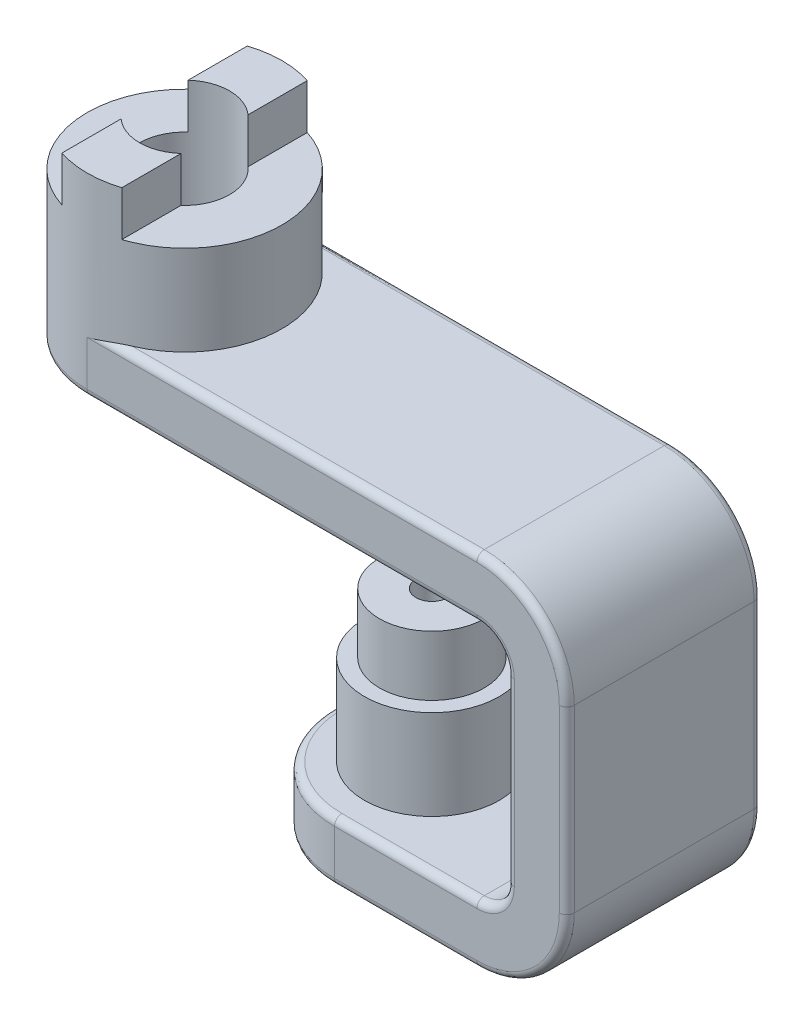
ISO-10303-21;
HEADER;
FILE_DESCRIPTION(('STEP AP214'),'2;1');
FILE_NAME('part.step','',(''),(''),'','','');
FILE_SCHEMA(('AUTOMOTIVE_DESIGN { 1 0 10303 214 1 1 1 1 }'));
ENDSEC;
DATA;
#1=APPLICATION_CONTEXT('core data for automotive mechanical design processes');
#2=APPLICATION_PROTOCOL_DEFINITION('international standard','automotive_design',2000,#1);
#3=PRODUCT_CONTEXT('',#1,'mechanical');
#4=PRODUCT('Part','Part','',(#3));
#5=PRODUCT_RELATED_PRODUCT_CATEGORY('part','',(#4));
#6=PRODUCT_DEFINITION_FORMATION('','',#4);
#7=PRODUCT_DEFINITION_CONTEXT('part definition',#1,'design');
#8=PRODUCT_DEFINITION('design','',#6,#7);
#9=PRODUCT_DEFINITION_SHAPE('','',#8);
#10=(LENGTH_UNIT() NAMED_UNIT(*) SI_UNIT(.MILLI.,.METRE.));
#11=(NAMED_UNIT(*) PLANE_ANGLE_UNIT() SI_UNIT($,.RADIAN.));
#12=(NAMED_UNIT(*) SI_UNIT($,.STERADIAN.) SOLID_ANGLE_UNIT());
#13=UNCERTAINTY_MEASURE_WITH_UNIT(LENGTH_MEASURE(1.E-05),#10,'distance_accuracy_value','');
#14=(GEOMETRIC_REPRESENTATION_CONTEXT(3) GLOBAL_UNCERTAINTY_ASSIGNED_CONTEXT((#13)) GLOBAL_UNIT_ASSIGNED_CONTEXT((#10,
#11,#12)) REPRESENTATION_CONTEXT('',''));
#15=CARTESIAN_POINT('',(0.,0.,0.));
#16=DIRECTION('',(0.,0.,1.));
#17=DIRECTION('',(1.,0.,0.));
#18=AXIS2_PLACEMENT_3D('',#15,#16,#17);
#19=CARTESIAN_POINT('',(-31.75,104.775,0.));
#20=DIRECTION('',(0.,-1.,0.));
#21=DIRECTION('',(1.,0.,0.));
#22=AXIS2_PLACEMENT_3D('',#19,#20,#21);
#23=PLANE('',#22);
#24=DIRECTION('',(0.,0.,1.));
#25=VECTOR('',#24,1.);
#26=CARTESIAN_POINT('',(-25.4,104.775,-19.6362905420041));
#27=LINE('',#26,#25);
#28=CARTESIAN_POINT('',(-25.4,104.775,7.09951582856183));
#29=VERTEX_POINT('',#28);
#30=CARTESIAN_POINT('',(-25.4,104.775,19.6362905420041));
#31=VERTEX_POINT('',#30);
#32=EDGE_CURVE('E273',#29,#31,#27,.T.);
#33=ORIENTED_EDGE('',*,*,#32,.F.);
#34=CARTESIAN_POINT('',(-31.75,104.775,0.));
#35=DIRECTION('',(0.,-1.,0.));
#36=DIRECTION('',(0.,0.,-1.));
#37=AXIS2_PLACEMENT_3D('',#34,#35,#36);
#38=CIRCLE('',#37,9.52499999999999);
#39=CARTESIAN_POINT('',(-38.1,104.775,7.09951582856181));
#40=VERTEX_POINT('',#39);
#41=EDGE_CURVE('E265',#29,#40,#38,.T.);
#42=ORIENTED_EDGE('',*,*,#41,.T.);
#43=DIRECTION('',(0.,0.,-1.));
#44=VECTOR('',#43,1.);
#45=CARTESIAN_POINT('',(-38.1,104.775,-19.6362905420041));
#46=LINE('',#45,#44);
#47=CARTESIAN_POINT('',(-38.1,104.775,19.6362905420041));
#48=VERTEX_POINT('',#47);
#49=EDGE_CURVE('E745',#48,#40,#46,.T.);
#50=ORIENTED_EDGE('',*,*,#49,.F.);
#51=CARTESIAN_POINT('',(-31.75,104.775,0.));
#52=DIRECTION('',(0.,-1.,0.));
#53=DIRECTION('',(1.,0.,0.));
#54=AXIS2_PLACEMENT_3D('',#51,#52,#53);
#55=CIRCLE('',#54,20.6375);
#56=EDGE_CURVE('E298',#31,#48,#55,.T.);
#57=ORIENTED_EDGE('',*,*,#56,.F.);
#58=EDGE_LOOP('',(#33,#42,#50,#57));
#59=FACE_BOUND('',#58,.T.);
#60=ADVANCED_FACE('F32',(#59),#23,.F.);
#61=CARTESIAN_POINT('',(-25.4,95.25,-19.6362905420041));
#62=DIRECTION('',(-1.,0.,0.));
#63=DIRECTION('',(0.,-1.,0.));
#64=AXIS2_PLACEMENT_3D('',#61,#62,#63);
#65=PLANE('',#64);
#66=CARTESIAN_POINT('',(-25.4,104.775,-19.6362905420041));
#67=VERTEX_POINT('',#66);
#68=CARTESIAN_POINT('',(-25.4,104.775,-7.09951582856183));
#69=VERTEX_POINT('',#68);
#70=EDGE_CURVE('E263',#67,#69,#27,.T.);
#71=ORIENTED_EDGE('',*,*,#70,.T.);
#72=DIRECTION('',(0.,-1.,0.));
#73=VECTOR('',#72,1.);
#74=CARTESIAN_POINT('',(-25.4,63.5,-7.09951582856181));
#75=LINE('',#74,#73);
#76=CARTESIAN_POINT('',(-25.4,95.25,-7.09951582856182));
#77=VERTEX_POINT('',#76);
#78=EDGE_CURVE('E244',#69,#77,#75,.T.);
#79=ORIENTED_EDGE('',*,*,#78,.T.);
#80=DIRECTION('',(0.,0.,1.));
#81=VECTOR('',#80,1.);
#82=CARTESIAN_POINT('',(-25.4,95.25,-19.6362905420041));
#83=LINE('',#82,#81);
#84=CARTESIAN_POINT('',(-25.4,95.25,-19.6362905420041));
#85=VERTEX_POINT('',#84);
#86=EDGE_CURVE('E282',#85,#77,#83,.T.);
#87=ORIENTED_EDGE('',*,*,#86,.F.);
#88=DIRECTION('',(0.,1.,0.));
#89=VECTOR('',#88,1.);
#90=CARTESIAN_POINT('',(-25.4,95.25,-19.6362905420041));
#91=LINE('',#90,#89);
#92=EDGE_CURVE('E271',#85,#67,#91,.T.);
#93=ORIENTED_EDGE('',*,*,#92,.T.);
#94=EDGE_LOOP('',(#71,#79,#87,#93));
#95=FACE_BOUND('',#94,.T.);
#96=ADVANCED_FACE('F269',(#95),#65,.F.);
#97=CARTESIAN_POINT('',(-38.1,95.25,-19.6362905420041));
#98=DIRECTION('',(1.,0.,0.));
#99=DIRECTION('',(0.,1.,0.));
#100=AXIS2_PLACEMENT_3D('',#97,#98,#99);
#101=PLANE('',#100);
#102=ORIENTED_EDGE('',*,*,#49,.T.);
#103=DIRECTION('',(0.,-1.,0.));
#104=VECTOR('',#103,1.);
#105=CARTESIAN_POINT('',(-38.1,63.5,7.09951582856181));
#106=LINE('',#105,#104);
#107=CARTESIAN_POINT('',(-38.1,95.25,7.0995158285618));
#108=VERTEX_POINT('',#107);
#109=EDGE_CURVE('E728',#40,#108,#106,.T.);
#110=ORIENTED_EDGE('',*,*,#109,.T.);
#111=DIRECTION('',(0.,0.,-1.));
#112=VECTOR('',#111,1.);
#113=CARTESIAN_POINT('',(-38.1,95.25,-19.6362905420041));
#114=LINE('',#113,#112);
#115=CARTESIAN_POINT('',(-38.1,95.25,19.6362905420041));
#116=VERTEX_POINT('',#115);
#117=EDGE_CURVE('E751',#116,#108,#114,.T.);
#118=ORIENTED_EDGE('',*,*,#117,.F.);
#119=DIRECTION('',(0.,1.,0.));
#120=VECTOR('',#119,1.);
#121=CARTESIAN_POINT('',(-38.1,95.25,19.6362905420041));
#122=LINE('',#121,#120);
#123=EDGE_CURVE('E279',#116,#48,#122,.T.);
#124=ORIENTED_EDGE('',*,*,#123,.T.);
#125=EDGE_LOOP('',(#102,#110,#118,#124));
#126=FACE_BOUND('',#125,.T.);
#127=ADVANCED_FACE('F509',(#126),#101,.F.);
#128=CARTESIAN_POINT('',(50.7999999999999,44.45,20.6375));
#129=DIRECTION('',(0.,-1.,0.));
#130=DIRECTION('',(1.,0.,0.));
#131=AXIS2_PLACEMENT_3D('',#128,#129,#130);
#132=PLANE('',#131);
#133=CARTESIAN_POINT('',(20.6375,44.45,0.));
#134=DIRECTION('',(0.,-1.,0.));
#135=DIRECTION('',(1.,0.,0.));
#136=AXIS2_PLACEMENT_3D('',#133,#134,#135);
#137=CIRCLE('',#136,11.1125);
#138=CARTESIAN_POINT('',(31.75,44.45,0.));
#139=VERTEX_POINT('',#138);
#140=EDGE_CURVE('E287',#139,#139,#137,.T.);
#141=ORIENTED_EDGE('',*,*,#140,.F.);
#142=EDGE_LOOP('',(#141));
#143=FACE_BOUND('',#142,.T.);
#144=CARTESIAN_POINT('',(20.6375,44.45,0.));
#145=DIRECTION('',(0.,-1.,0.));
#146=DIRECTION('',(1.,0.,0.));
#147=AXIS2_PLACEMENT_3D('',#144,#145,#146);
#148=CIRCLE('',#147,3.37819999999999);
#149=CARTESIAN_POINT('',(24.0157,44.45,0.));
#150=VERTEX_POINT('',#149);
#151=EDGE_CURVE('E742',#150,#150,#148,.F.);
#152=ORIENTED_EDGE('',*,*,#151,.F.);
#153=EDGE_LOOP('',(#152));
#154=FACE_BOUND('',#153,.T.);
#155=ADVANCED_FACE('F530',(#143,#154),#132,.F.);
#156=CARTESIAN_POINT('',(50.7999999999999,31.75,20.6375));
#157=DIRECTION('',(0.,-1.,0.));
#158=DIRECTION('',(1.,0.,0.));
#159=AXIS2_PLACEMENT_3D('',#156,#157,#158);
#160=PLANE('',#159);
#161=CARTESIAN_POINT('',(20.6375,31.75,0.));
#162=DIRECTION('',(0.,-1.,0.));
#163=DIRECTION('',(1.,0.,0.));
#164=AXIS2_PLACEMENT_3D('',#161,#162,#163);
#165=CIRCLE('',#164,14.2875);
#166=CARTESIAN_POINT('',(34.925,31.75,0.));
#167=VERTEX_POINT('',#166);
#168=EDGE_CURVE('E294',#167,#167,#165,.T.);
#169=ORIENTED_EDGE('',*,*,#168,.F.);
#170=EDGE_LOOP('',(#169));
#171=FACE_BOUND('',#170,.T.);
#172=CARTESIAN_POINT('',(20.6375,31.75,0.));
#173=DIRECTION('',(0.,-1.,0.));
#174=DIRECTION('',(1.,0.,0.));
#175=AXIS2_PLACEMENT_3D('',#172,#173,#174);
#176=CIRCLE('',#175,11.1125);
#177=CARTESIAN_POINT('',(31.75,31.75,0.));
#178=VERTEX_POINT('',#177);
#179=EDGE_CURVE('E340',#178,#178,#176,.F.);
#180=ORIENTED_EDGE('',*,*,#179,.F.);
#181=EDGE_LOOP('',(#180));
#182=FACE_BOUND('',#181,.T.);
#183=ADVANCED_FACE('F480',(#171,#182),#160,.F.);
#184=CARTESIAN_POINT('',(0.,12.7,20.6375));
#185=DIRECTION('',(0.,1.,0.));
#186=DIRECTION('',(0.,0.,1.));
#187=AXIS2_PLACEMENT_3D('',#184,#185,#186);
#188=PLANE('',#187);
#189=CARTESIAN_POINT('',(20.6375,12.7,0.));
#190=DIRECTION('',(0.,1.,0.));
#191=DIRECTION('',(0.,0.,1.));
#192=AXIS2_PLACEMENT_3D('',#189,#190,#191);
#193=CIRCLE('',#192,19.05);
#194=CARTESIAN_POINT('',(20.6375,12.7,-19.05));
#195=VERTEX_POINT('',#194);
#196=CARTESIAN_POINT('',(20.6375,12.7,19.05));
#197=VERTEX_POINT('',#196);
#198=EDGE_CURVE('E381',#195,#197,#193,.T.);
#199=ORIENTED_EDGE('',*,*,#198,.T.);
#200=DIRECTION('',(1.,0.,0.));
#201=VECTOR('',#200,1.);
#202=CARTESIAN_POINT('',(0.,12.7,19.05));
#203=LINE('',#202,#201);
#204=CARTESIAN_POINT('',(50.7999999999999,12.7,19.05));
#205=VERTEX_POINT('',#204);
#206=EDGE_CURVE('E383',#197,#205,#203,.T.);
#207=ORIENTED_EDGE('',*,*,#206,.T.);
#208=DIRECTION('',(0.,0.,-1.));
#209=VECTOR('',#208,1.);
#210=CARTESIAN_POINT('',(50.7999999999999,12.7,20.6375));
#211=LINE('',#210,#209);
#212=CARTESIAN_POINT('',(50.7999999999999,12.7,-19.05));
#213=VERTEX_POINT('',#212);
#214=EDGE_CURVE('E322',#205,#213,#211,.T.);
#215=ORIENTED_EDGE('',*,*,#214,.T.);
#216=DIRECTION('',(1.,0.,0.));
#217=VECTOR('',#216,1.);
#218=CARTESIAN_POINT('',(20.6375,12.7,-19.05));
#219=LINE('',#218,#217);
#220=EDGE_CURVE('E379',#213,#195,#219,.F.);
#221=ORIENTED_EDGE('',*,*,#220,.T.);
#222=EDGE_LOOP('',(#199,#207,#215,#221));
#223=FACE_BOUND('',#222,.T.);
#224=CARTESIAN_POINT('',(20.6375,12.7,0.));
#225=DIRECTION('',(0.,1.,0.));
#226=DIRECTION('',(0.,0.,1.));
#227=AXIS2_PLACEMENT_3D('',#224,#225,#226);
#228=CIRCLE('',#227,14.2875);
#229=CARTESIAN_POINT('',(20.6375,12.7,14.2875));
#230=VERTEX_POINT('',#229);
#231=EDGE_CURVE('E291',#230,#230,#228,.T.);
#232=ORIENTED_EDGE('',*,*,#231,.F.);
#233=EDGE_LOOP('',(#232));
#234=FACE_BOUND('',#233,.T.);
#235=ADVANCED_FACE('F477',(#223,#234),#188,.T.);
#236=CARTESIAN_POINT('',(20.6375,12.7,0.));
#237=DIRECTION('',(0.,1.,0.));
#238=DIRECTION('',(0.,0.,1.));
#239=AXIS2_PLACEMENT_3D('',#236,#237,#238);
#240=CYLINDRICAL_SURFACE('',#239,20.6375);
#241=DIRECTION('',(0.,1.,0.));
#242=VECTOR('',#241,1.);
#243=CARTESIAN_POINT('',(20.6375,57.15,20.6375));
#244=LINE('',#243,#242);
#245=CARTESIAN_POINT('',(20.6375,11.1125,20.6375));
#246=VERTEX_POINT('',#245);
#247=CARTESIAN_POINT('',(20.6375,1.5875,20.6375));
#248=VERTEX_POINT('',#247);
#249=EDGE_CURVE('E334',#246,#248,#244,.F.);
#250=ORIENTED_EDGE('',*,*,#249,.F.);
#251=CARTESIAN_POINT('',(20.6375,11.1125,0.));
#252=DIRECTION('',(0.,1.,0.));
#253=DIRECTION('',(0.,0.,1.));
#254=AXIS2_PLACEMENT_3D('',#251,#252,#253);
#255=CIRCLE('',#254,20.6375);
#256=CARTESIAN_POINT('',(20.6375,11.1125,-20.6375));
#257=VERTEX_POINT('',#256);
#258=EDGE_CURVE('E387',#246,#257,#255,.F.);
#259=ORIENTED_EDGE('',*,*,#258,.T.);
#260=DIRECTION('',(0.,-1.,0.));
#261=VECTOR('',#260,1.);
#262=CARTESIAN_POINT('',(20.6375,12.7,-20.6375));
#263=LINE('',#262,#261);
#264=CARTESIAN_POINT('',(20.6375,1.5875,-20.6375));
#265=VERTEX_POINT('',#264);
#266=EDGE_CURVE('E337',#265,#257,#263,.F.);
#267=ORIENTED_EDGE('',*,*,#266,.F.);
#268=CARTESIAN_POINT('',(20.6375,1.5875,0.));
#269=DIRECTION('',(0.,1.,0.));
#270=DIRECTION('',(0.,0.,1.));
#271=AXIS2_PLACEMENT_3D('',#268,#269,#270);
#272=CIRCLE('',#271,20.6375);
#273=EDGE_CURVE('E385',#265,#248,#272,.T.);
#274=ORIENTED_EDGE('',*,*,#273,.T.);
#275=EDGE_LOOP('',(#250,#259,#267,#274));
#276=FACE_BOUND('',#275,.T.);
#277=ADVANCED_FACE('F34',(#276),#240,.T.);
#278=CARTESIAN_POINT('',(50.7999999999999,76.2,20.6375));
#279=DIRECTION('',(0.,-1.,0.));
#280=DIRECTION('',(1.,0.,0.));
#281=AXIS2_PLACEMENT_3D('',#278,#279,#280);
#282=PLANE('',#281);
#283=DIRECTION('',(0.,0.,-1.));
#284=VECTOR('',#283,1.);
#285=CARTESIAN_POINT('',(50.7999999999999,76.2,20.6375));
#286=LINE('',#285,#284);
#287=CARTESIAN_POINT('',(50.7999999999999,76.2,19.05));
#288=VERTEX_POINT('',#287);
#289=CARTESIAN_POINT('',(50.7999999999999,76.2,-19.05));
#290=VERTEX_POINT('',#289);
#291=EDGE_CURVE('E310',#288,#290,#286,.T.);
#292=ORIENTED_EDGE('',*,*,#291,.T.);
#293=DIRECTION('',(-1.,0.,0.));
#294=VECTOR('',#293,1.);
#295=CARTESIAN_POINT('',(50.7999999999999,76.2,-19.05));
#296=LINE('',#295,#294);
#297=CARTESIAN_POINT('',(-23.8125,76.2,-19.05));
#298=VERTEX_POINT('',#297);
#299=EDGE_CURVE('E419',#290,#298,#296,.T.);
#300=ORIENTED_EDGE('',*,*,#299,.T.);
#301=CARTESIAN_POINT('',(-31.75,76.2,0.));
#302=DIRECTION('',(0.,-1.,0.));
#303=DIRECTION('',(1.,0.,0.));
#304=AXIS2_PLACEMENT_3D('',#301,#302,#303);
#305=CIRCLE('',#304,20.6375);
#306=CARTESIAN_POINT('',(-23.8125,76.2,19.05));
#307=VERTEX_POINT('',#306);
#308=EDGE_CURVE('E301',#298,#307,#305,.T.);
#309=ORIENTED_EDGE('',*,*,#308,.T.);
#310=DIRECTION('',(-1.,0.,0.));
#311=VECTOR('',#310,1.);
#312=CARTESIAN_POINT('',(50.7999999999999,76.2,19.05));
#313=LINE('',#312,#311);
#314=EDGE_CURVE('E417',#307,#288,#313,.F.);
#315=ORIENTED_EDGE('',*,*,#314,.T.);
#316=EDGE_LOOP('',(#292,#300,#309,#315));
#317=FACE_BOUND('',#316,.T.);
#318=ADVANCED_FACE('F495',(#317),#282,.F.);
#319=CARTESIAN_POINT('',(50.7999999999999,63.5,20.6375));
#320=DIRECTION('',(0.,-1.,0.));
#321=DIRECTION('',(1.,0.,0.));
#322=AXIS2_PLACEMENT_3D('',#319,#320,#321);
#323=PLANE('',#322);
#324=CARTESIAN_POINT('',(-31.75,63.5,0.));
#325=DIRECTION('',(0.,-1.,0.));
#326=DIRECTION('',(0.,0.,-1.));
#327=AXIS2_PLACEMENT_3D('',#324,#325,#326);
#328=CIRCLE('',#327,9.52499999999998);
#329=CARTESIAN_POINT('',(-31.75,63.5,-9.52499999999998));
#330=VERTEX_POINT('',#329);
#331=EDGE_CURVE('E723',#330,#330,#328,.T.);
#332=ORIENTED_EDGE('',*,*,#331,.F.);
#333=EDGE_LOOP('',(#332));
#334=FACE_BOUND('',#333,.T.);
#335=CARTESIAN_POINT('',(-31.75,63.5,0.));
#336=DIRECTION('',(0.,-1.,0.));
#337=DIRECTION('',(1.,0.,0.));
#338=AXIS2_PLACEMENT_3D('',#335,#336,#337);
#339=CIRCLE('',#338,19.05);
#340=CARTESIAN_POINT('',(-31.75,63.5,19.05));
#341=VERTEX_POINT('',#340);
#342=CARTESIAN_POINT('',(-31.75,63.5,-19.05));
#343=VERTEX_POINT('',#342);
#344=EDGE_CURVE('E411',#341,#343,#339,.T.);
#345=ORIENTED_EDGE('',*,*,#344,.T.);
#346=DIRECTION('',(-1.,0.,0.));
#347=VECTOR('',#346,1.);
#348=CARTESIAN_POINT('',(50.7999999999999,63.5,-19.05));
#349=LINE('',#348,#347);
#350=CARTESIAN_POINT('',(50.7999999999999,63.5,-19.05));
#351=VERTEX_POINT('',#350);
#352=EDGE_CURVE('E413',#343,#351,#349,.F.);
#353=ORIENTED_EDGE('',*,*,#352,.T.);
#354=DIRECTION('',(0.,0.,-1.));
#355=VECTOR('',#354,1.);
#356=CARTESIAN_POINT('',(50.7999999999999,63.5,20.6375));
#357=LINE('',#356,#355);
#358=CARTESIAN_POINT('',(50.7999999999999,63.5,19.05));
#359=VERTEX_POINT('',#358);
#360=EDGE_CURVE('E331',#359,#351,#357,.T.);
#361=ORIENTED_EDGE('',*,*,#360,.F.);
#362=DIRECTION('',(-1.,0.,0.));
#363=VECTOR('',#362,1.);
#364=CARTESIAN_POINT('',(50.7999999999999,63.5,19.05));
#365=LINE('',#364,#363);
#366=EDGE_CURVE('E409',#359,#341,#365,.T.);
#367=ORIENTED_EDGE('',*,*,#366,.T.);
#368=EDGE_LOOP('',(#345,#353,#361,#367));
#369=FACE_BOUND('',#368,.T.);
#370=ADVANCED_FACE('F492',(#334,#369),#323,.T.);
#371=CARTESIAN_POINT('',(50.8,57.15,20.6375));
#372=DIRECTION('',(0.,0.,-1.));
#373=DIRECTION('',(-1.,0.,0.));
#374=AXIS2_PLACEMENT_3D('',#371,#372,#373);
#375=CYLINDRICAL_SURFACE('',#374,6.35);
#376=DIRECTION('',(0.,0.,-1.));
#377=VECTOR('',#376,1.);
#378=CARTESIAN_POINT('',(57.15,57.1499999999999,20.6375));
#379=LINE('',#378,#377);
#380=CARTESIAN_POINT('',(57.15,57.1499999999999,19.05));
#381=VERTEX_POINT('',#380);
#382=CARTESIAN_POINT('',(57.15,57.1499999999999,-19.05));
#383=VERTEX_POINT('',#382);
#384=EDGE_CURVE('E328',#381,#383,#379,.T.);
#385=ORIENTED_EDGE('',*,*,#384,.F.);
#386=CARTESIAN_POINT('',(50.8,57.15,19.05));
#387=DIRECTION('',(0.,0.,1.));
#388=DIRECTION('',(1.,0.,0.));
#389=AXIS2_PLACEMENT_3D('',#386,#387,#388);
#390=CIRCLE('',#389,6.35);
#391=EDGE_CURVE('E347',#381,#359,#390,.T.);
#392=ORIENTED_EDGE('',*,*,#391,.T.);
#393=ORIENTED_EDGE('',*,*,#360,.T.);
#394=CARTESIAN_POINT('',(50.8,57.15,-19.05));
#395=DIRECTION('',(0.,0.,1.));
#396=DIRECTION('',(1.,0.,0.));
#397=AXIS2_PLACEMENT_3D('',#394,#395,#396);
#398=CIRCLE('',#397,6.35);
#399=EDGE_CURVE('E345',#351,#383,#398,.F.);
#400=ORIENTED_EDGE('',*,*,#399,.T.);
#401=EDGE_LOOP('',(#385,#392,#393,#400));
#402=FACE_BOUND('',#401,.T.);
#403=ADVANCED_FACE('F488',(#402),#375,.F.);
#404=CARTESIAN_POINT('',(57.15,19.0500000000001,20.6375));
#405=DIRECTION('',(-1.,0.,0.));
#406=DIRECTION('',(0.,0.,1.));
#407=AXIS2_PLACEMENT_3D('',#404,#405,#406);
#408=PLANE('',#407);
#409=DIRECTION('',(0.,0.,-1.));
#410=VECTOR('',#409,1.);
#411=CARTESIAN_POINT('',(57.15,19.0500000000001,20.6375));
#412=LINE('',#411,#410);
#413=CARTESIAN_POINT('',(57.15,19.0500000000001,19.05));
#414=VERTEX_POINT('',#413);
#415=CARTESIAN_POINT('',(57.15,19.0500000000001,-19.05));
#416=VERTEX_POINT('',#415);
#417=EDGE_CURVE('E325',#414,#416,#412,.T.);
#418=ORIENTED_EDGE('',*,*,#417,.F.);
#419=DIRECTION('',(0.,1.,0.));
#420=VECTOR('',#419,1.);
#421=CARTESIAN_POINT('',(57.15,19.0500000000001,19.05));
#422=LINE('',#421,#420);
#423=EDGE_CURVE('E373',#414,#381,#422,.T.);
#424=ORIENTED_EDGE('',*,*,#423,.T.);
#425=ORIENTED_EDGE('',*,*,#384,.T.);
#426=DIRECTION('',(0.,1.,0.));
#427=VECTOR('',#426,1.);
#428=CARTESIAN_POINT('',(57.15,19.0500000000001,-19.05));
#429=LINE('',#428,#427);
#430=EDGE_CURVE('E371',#383,#416,#429,.F.);
#431=ORIENTED_EDGE('',*,*,#430,.T.);
#432=EDGE_LOOP('',(#418,#424,#425,#431));
#433=FACE_BOUND('',#432,.T.);
#434=ADVANCED_FACE('F484',(#433),#408,.T.);
#435=CARTESIAN_POINT('',(50.8,19.05,20.6375));
#436=DIRECTION('',(0.,0.,-1.));
#437=DIRECTION('',(-1.,0.,0.));
#438=AXIS2_PLACEMENT_3D('',#435,#436,#437);
#439=CYLINDRICAL_SURFACE('',#438,6.35);
#440=ORIENTED_EDGE('',*,*,#214,.F.);
#441=CARTESIAN_POINT('',(50.8,19.05,19.05));
#442=DIRECTION('',(0.,0.,1.));
#443=DIRECTION('',(1.,0.,0.));
#444=AXIS2_PLACEMENT_3D('',#441,#442,#443);
#445=CIRCLE('',#444,6.35);
#446=EDGE_CURVE('E377',#205,#414,#445,.T.);
#447=ORIENTED_EDGE('',*,*,#446,.T.);
#448=ORIENTED_EDGE('',*,*,#417,.T.);
#449=CARTESIAN_POINT('',(50.8,19.05,-19.05));
#450=DIRECTION('',(0.,0.,1.));
#451=DIRECTION('',(1.,0.,0.));
#452=AXIS2_PLACEMENT_3D('',#449,#450,#451);
#453=CIRCLE('',#452,6.35);
#454=EDGE_CURVE('E375',#416,#213,#453,.F.);
#455=ORIENTED_EDGE('',*,*,#454,.T.);
#456=EDGE_LOOP('',(#440,#447,#448,#455));
#457=FACE_BOUND('',#456,.T.);
#458=ADVANCED_FACE('F475',(#457),#439,.F.);
#459=CARTESIAN_POINT('',(0.,0.,20.6375));
#460=DIRECTION('',(0.,1.,0.));
#461=DIRECTION('',(0.,0.,1.));
#462=AXIS2_PLACEMENT_3D('',#459,#460,#461);
#463=PLANE('',#462);
#464=CARTESIAN_POINT('',(20.6375,0.,0.));
#465=DIRECTION('',(0.,-1.,0.));
#466=DIRECTION('',(0.,0.,-1.));
#467=AXIS2_PLACEMENT_3D('',#464,#465,#466);
#468=CIRCLE('',#467,9.525);
#469=CARTESIAN_POINT('',(20.6375,0.,-9.525));
#470=VERTEX_POINT('',#469);
#471=EDGE_CURVE('E739',#470,#470,#468,.T.);
#472=ORIENTED_EDGE('',*,*,#471,.F.);
#473=EDGE_LOOP('',(#472));
#474=FACE_BOUND('',#473,.T.);
#475=CARTESIAN_POINT('',(20.6375,0.,0.));
#476=DIRECTION('',(0.,1.,0.));
#477=DIRECTION('',(0.,0.,1.));
#478=AXIS2_PLACEMENT_3D('',#475,#476,#477);
#479=CIRCLE('',#478,19.05);
#480=CARTESIAN_POINT('',(20.6375,0.,19.05));
#481=VERTEX_POINT('',#480);
#482=CARTESIAN_POINT('',(20.6375,0.,-19.05));
#483=VERTEX_POINT('',#482);
#484=EDGE_CURVE('E52',#481,#483,#479,.F.);
#485=ORIENTED_EDGE('',*,*,#484,.T.);
#486=DIRECTION('',(1.,0.,0.));
#487=VECTOR('',#486,1.);
#488=CARTESIAN_POINT('',(0.,0.,-19.05));
#489=LINE('',#488,#487);
#490=CARTESIAN_POINT('',(50.7999999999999,0.,-19.05));
#491=VERTEX_POINT('',#490);
#492=EDGE_CURVE('E436',#483,#491,#489,.T.);
#493=ORIENTED_EDGE('',*,*,#492,.T.);
#494=DIRECTION('',(0.,0.,-1.));
#495=VECTOR('',#494,1.);
#496=CARTESIAN_POINT('',(50.7999999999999,0.,20.6375));
#497=LINE('',#496,#495);
#498=CARTESIAN_POINT('',(50.7999999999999,0.,19.05));
#499=VERTEX_POINT('',#498);
#500=EDGE_CURVE('E319',#499,#491,#497,.T.);
#501=ORIENTED_EDGE('',*,*,#500,.F.);
#502=DIRECTION('',(1.,0.,0.));
#503=VECTOR('',#502,1.);
#504=CARTESIAN_POINT('',(20.6375,0.,19.05));
#505=LINE('',#504,#503);
#506=EDGE_CURVE('E57',#499,#481,#505,.F.);
#507=ORIENTED_EDGE('',*,*,#506,.T.);
#508=EDGE_LOOP('',(#485,#493,#501,#507));
#509=FACE_BOUND('',#508,.T.);
#510=ADVANCED_FACE('F471',(#474,#509),#463,.F.);
#511=CARTESIAN_POINT('',(50.8,19.05,20.6375));
#512=DIRECTION('',(0.,0.,-1.));
#513=DIRECTION('',(-1.,0.,0.));
#514=AXIS2_PLACEMENT_3D('',#511,#512,#513);
#515=CYLINDRICAL_SURFACE('',#514,19.05);
#516=ORIENTED_EDGE('',*,*,#500,.T.);
#517=CARTESIAN_POINT('',(50.8,19.05,-19.05));
#518=DIRECTION('',(0.,0.,1.));
#519=DIRECTION('',(1.,0.,0.));
#520=AXIS2_PLACEMENT_3D('',#517,#518,#519);
#521=CIRCLE('',#520,19.05);
#522=CARTESIAN_POINT('',(69.85,19.0500000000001,-19.05));
#523=VERTEX_POINT('',#522);
#524=EDGE_CURVE('E432',#491,#523,#521,.T.);
#525=ORIENTED_EDGE('',*,*,#524,.T.);
#526=DIRECTION('',(0.,0.,-1.));
#527=VECTOR('',#526,1.);
#528=CARTESIAN_POINT('',(69.85,19.0500000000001,20.6375));
#529=LINE('',#528,#527);
#530=CARTESIAN_POINT('',(69.85,19.0500000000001,19.05));
#531=VERTEX_POINT('',#530);
#532=EDGE_CURVE('E316',#531,#523,#529,.T.);
#533=ORIENTED_EDGE('',*,*,#532,.F.);
#534=CARTESIAN_POINT('',(50.8,19.05,19.05));
#535=DIRECTION('',(0.,0.,1.));
#536=DIRECTION('',(1.,0.,0.));
#537=AXIS2_PLACEMENT_3D('',#534,#535,#536);
#538=CIRCLE('',#537,19.05);
#539=EDGE_CURVE('E430',#531,#499,#538,.F.);
#540=ORIENTED_EDGE('',*,*,#539,.T.);
#541=EDGE_LOOP('',(#516,#525,#533,#540));
#542=FACE_BOUND('',#541,.T.);
#543=ADVANCED_FACE('F467',(#542),#515,.T.);
#544=CARTESIAN_POINT('',(69.85,19.0500000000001,20.6375));
#545=DIRECTION('',(-1.,0.,0.));
#546=DIRECTION('',(0.,0.,1.));
#547=AXIS2_PLACEMENT_3D('',#544,#545,#546);
#548=PLANE('',#547);
#549=ORIENTED_EDGE('',*,*,#532,.T.);
#550=DIRECTION('',(0.,1.,0.));
#551=VECTOR('',#550,1.);
#552=CARTESIAN_POINT('',(69.85,19.0500000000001,-19.05));
#553=LINE('',#552,#551);
#554=CARTESIAN_POINT('',(69.85,57.1499999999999,-19.05));
#555=VERTEX_POINT('',#554);
#556=EDGE_CURVE('E428',#523,#555,#553,.T.);
#557=ORIENTED_EDGE('',*,*,#556,.T.);
#558=DIRECTION('',(0.,0.,-1.));
#559=VECTOR('',#558,1.);
#560=CARTESIAN_POINT('',(69.85,57.1499999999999,20.6375));
#561=LINE('',#560,#559);
#562=CARTESIAN_POINT('',(69.85,57.1499999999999,19.05));
#563=VERTEX_POINT('',#562);
#564=EDGE_CURVE('E313',#563,#555,#561,.T.);
#565=ORIENTED_EDGE('',*,*,#564,.F.);
#566=DIRECTION('',(0.,1.,0.));
#567=VECTOR('',#566,1.);
#568=CARTESIAN_POINT('',(69.85,19.0500000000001,19.05));
#569=LINE('',#568,#567);
#570=EDGE_CURVE('E426',#563,#531,#569,.F.);
#571=ORIENTED_EDGE('',*,*,#570,.T.);
#572=EDGE_LOOP('',(#549,#557,#565,#571));
#573=FACE_BOUND('',#572,.T.);
#574=ADVANCED_FACE('F463',(#573),#548,.F.);
#575=CARTESIAN_POINT('',(50.8,57.15,20.6375));
#576=DIRECTION('',(0.,0.,-1.));
#577=DIRECTION('',(-1.,0.,0.));
#578=AXIS2_PLACEMENT_3D('',#575,#576,#577);
#579=CYLINDRICAL_SURFACE('',#578,19.05);
#580=ORIENTED_EDGE('',*,*,#564,.T.);
#581=CARTESIAN_POINT('',(50.8,57.15,-19.05));
#582=DIRECTION('',(0.,0.,1.));
#583=DIRECTION('',(1.,0.,0.));
#584=AXIS2_PLACEMENT_3D('',#581,#582,#583);
#585=CIRCLE('',#584,19.05);
#586=EDGE_CURVE('E424',#555,#290,#585,.T.);
#587=ORIENTED_EDGE('',*,*,#586,.T.);
#588=ORIENTED_EDGE('',*,*,#291,.F.);
#589=CARTESIAN_POINT('',(50.8,57.15,19.05));
#590=DIRECTION('',(0.,0.,1.));
#591=DIRECTION('',(1.,0.,0.));
#592=AXIS2_PLACEMENT_3D('',#589,#590,#591);
#593=CIRCLE('',#592,19.05);
#594=EDGE_CURVE('E422',#288,#563,#593,.F.);
#595=ORIENTED_EDGE('',*,*,#594,.T.);
#596=EDGE_LOOP('',(#580,#587,#588,#595));
#597=FACE_BOUND('',#596,.T.);
#598=ADVANCED_FACE('F459',(#597),#579,.T.);
#599=CARTESIAN_POINT('',(50.8,57.15,20.6375));
#600=DIRECTION('',(0.,0.,1.));
#601=DIRECTION('',(1.,0.,0.));
#602=AXIS2_PLACEMENT_3D('',#599,#600,#601);
#603=PLANE('',#602);
#604=CARTESIAN_POINT('',(50.8,19.05,20.6375));
#605=DIRECTION('',(0.,0.,1.));
#606=DIRECTION('',(1.,0.,0.));
#607=AXIS2_PLACEMENT_3D('',#604,#605,#606);
#608=CIRCLE('',#607,7.9375);
#609=CARTESIAN_POINT('',(58.7375,19.0500000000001,20.6375));
#610=VERTEX_POINT('',#609);
#611=CARTESIAN_POINT('',(50.7999999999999,11.1125,20.6375));
#612=VERTEX_POINT('',#611);
#613=EDGE_CURVE('E367',#610,#612,#608,.F.);
#614=ORIENTED_EDGE('',*,*,#613,.T.);
#615=DIRECTION('',(1.,0.,0.));
#616=VECTOR('',#615,1.);
#617=CARTESIAN_POINT('',(50.8,11.1125,20.6375));
#618=LINE('',#617,#616);
#619=EDGE_CURVE('E369',#612,#246,#618,.F.);
#620=ORIENTED_EDGE('',*,*,#619,.T.);
#621=ORIENTED_EDGE('',*,*,#249,.T.);
#622=DIRECTION('',(1.,0.,0.));
#623=VECTOR('',#622,1.);
#624=CARTESIAN_POINT('',(50.7999999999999,1.5875,20.6375));
#625=LINE('',#624,#623);
#626=CARTESIAN_POINT('',(50.7999999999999,1.5875,20.6375));
#627=VERTEX_POINT('',#626);
#628=EDGE_CURVE('E358',#248,#627,#625,.T.);
#629=ORIENTED_EDGE('',*,*,#628,.T.);
#630=CARTESIAN_POINT('',(50.8,19.05,20.6375));
#631=DIRECTION('',(0.,0.,1.));
#632=DIRECTION('',(1.,0.,0.));
#633=AXIS2_PLACEMENT_3D('',#630,#631,#632);
#634=CIRCLE('',#633,17.4625);
#635=CARTESIAN_POINT('',(68.2625,19.0500000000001,20.6375));
#636=VERTEX_POINT('',#635);
#637=EDGE_CURVE('E356',#627,#636,#634,.T.);
#638=ORIENTED_EDGE('',*,*,#637,.T.);
#639=DIRECTION('',(0.,1.,0.));
#640=VECTOR('',#639,1.);
#641=CARTESIAN_POINT('',(68.2625,57.1499999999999,20.6375));
#642=LINE('',#641,#640);
#643=CARTESIAN_POINT('',(68.2625,57.1499999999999,20.6375));
#644=VERTEX_POINT('',#643);
#645=EDGE_CURVE('E354',#636,#644,#642,.T.);
#646=ORIENTED_EDGE('',*,*,#645,.T.);
#647=CARTESIAN_POINT('',(50.8,57.15,20.6375));
#648=DIRECTION('',(0.,0.,1.));
#649=DIRECTION('',(1.,0.,0.));
#650=AXIS2_PLACEMENT_3D('',#647,#648,#649);
#651=CIRCLE('',#650,17.4625);
#652=CARTESIAN_POINT('',(50.7999999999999,74.6125,20.6375));
#653=VERTEX_POINT('',#652);
#654=EDGE_CURVE('E352',#644,#653,#651,.T.);
#655=ORIENTED_EDGE('',*,*,#654,.T.);
#656=DIRECTION('',(-1.,0.,0.));
#657=VECTOR('',#656,1.);
#658=CARTESIAN_POINT('',(-31.75,74.6125,20.6375));
#659=LINE('',#658,#657);
#660=CARTESIAN_POINT('',(-31.75,74.6125,20.6375));
#661=VERTEX_POINT('',#660);
#662=EDGE_CURVE('E350',#653,#661,#659,.T.);
#663=ORIENTED_EDGE('',*,*,#662,.T.);
#664=DIRECTION('',(0.,1.,0.));
#665=VECTOR('',#664,1.);
#666=CARTESIAN_POINT('',(-31.75,63.5,20.6375));
#667=LINE('',#666,#665);
#668=CARTESIAN_POINT('',(-31.75,65.0875,20.6375));
#669=VERTEX_POINT('',#668);
#670=EDGE_CURVE('E307',#669,#661,#667,.T.);
#671=ORIENTED_EDGE('',*,*,#670,.F.);
#672=DIRECTION('',(-1.,0.,0.));
#673=VECTOR('',#672,1.);
#674=CARTESIAN_POINT('',(50.8,65.0875,20.6375));
#675=LINE('',#674,#673);
#676=CARTESIAN_POINT('',(50.7999999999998,65.0875,20.6375));
#677=VERTEX_POINT('',#676);
#678=EDGE_CURVE('E360',#669,#677,#675,.F.);
#679=ORIENTED_EDGE('',*,*,#678,.T.);
#680=CARTESIAN_POINT('',(50.8,57.15,20.6375));
#681=DIRECTION('',(0.,0.,1.));
#682=DIRECTION('',(1.,0.,0.));
#683=AXIS2_PLACEMENT_3D('',#680,#681,#682);
#684=CIRCLE('',#683,7.9375);
#685=CARTESIAN_POINT('',(58.7375,57.1499999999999,20.6375));
#686=VERTEX_POINT('',#685);
#687=EDGE_CURVE('E362',#677,#686,#684,.F.);
#688=ORIENTED_EDGE('',*,*,#687,.T.);
#689=DIRECTION('',(0.,1.,0.));
#690=VECTOR('',#689,1.);
#691=CARTESIAN_POINT('',(58.7375,57.15,20.6375));
#692=LINE('',#691,#690);
#693=EDGE_CURVE('E365',#686,#610,#692,.F.);
#694=ORIENTED_EDGE('',*,*,#693,.T.);
#695=EDGE_LOOP('',(#614,#620,#621,#629,#638,#646,#655,#663,#671,#679,#688,#694));
#696=FACE_BOUND('',#695,.T.);
#697=ADVANCED_FACE('F455',(#696),#603,.T.);
#698=CARTESIAN_POINT('',(50.8,57.15,-20.6375));
#699=DIRECTION('',(0.,0.,1.));
#700=DIRECTION('',(1.,0.,0.));
#701=AXIS2_PLACEMENT_3D('',#698,#699,#700);
#702=PLANE('',#701);
#703=ORIENTED_EDGE('',*,*,#266,.T.);
#704=DIRECTION('',(1.,0.,0.));
#705=VECTOR('',#704,1.);
#706=CARTESIAN_POINT('',(50.7999999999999,11.1125,-20.6375));
#707=LINE('',#706,#705);
#708=CARTESIAN_POINT('',(50.7999999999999,11.1125,-20.6375));
#709=VERTEX_POINT('',#708);
#710=EDGE_CURVE('E407',#257,#709,#707,.T.);
#711=ORIENTED_EDGE('',*,*,#710,.T.);
#712=CARTESIAN_POINT('',(50.8,19.05,-20.6375));
#713=DIRECTION('',(0.,0.,1.));
#714=DIRECTION('',(1.,0.,0.));
#715=AXIS2_PLACEMENT_3D('',#712,#713,#714);
#716=CIRCLE('',#715,7.9375);
#717=CARTESIAN_POINT('',(58.7375,19.0500000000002,-20.6375));
#718=VERTEX_POINT('',#717);
#719=EDGE_CURVE('E405',#709,#718,#716,.T.);
#720=ORIENTED_EDGE('',*,*,#719,.T.);
#721=DIRECTION('',(0.,1.,0.));
#722=VECTOR('',#721,1.);
#723=CARTESIAN_POINT('',(58.7375,57.1499999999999,-20.6375));
#724=LINE('',#723,#722);
#725=CARTESIAN_POINT('',(58.7375,57.1499999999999,-20.6375));
#726=VERTEX_POINT('',#725);
#727=EDGE_CURVE('E403',#718,#726,#724,.T.);
#728=ORIENTED_EDGE('',*,*,#727,.T.);
#729=CARTESIAN_POINT('',(50.8,57.15,-20.6375));
#730=DIRECTION('',(0.,0.,1.));
#731=DIRECTION('',(1.,0.,0.));
#732=AXIS2_PLACEMENT_3D('',#729,#730,#731);
#733=CIRCLE('',#732,7.9375);
#734=CARTESIAN_POINT('',(50.7999999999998,65.0875,-20.6375));
#735=VERTEX_POINT('',#734);
#736=EDGE_CURVE('E401',#726,#735,#733,.T.);
#737=ORIENTED_EDGE('',*,*,#736,.T.);
#738=DIRECTION('',(-1.,0.,0.));
#739=VECTOR('',#738,1.);
#740=CARTESIAN_POINT('',(-31.75,65.0875,-20.6375));
#741=LINE('',#740,#739);
#742=CARTESIAN_POINT('',(-31.75,65.0875,-20.6375));
#743=VERTEX_POINT('',#742);
#744=EDGE_CURVE('E399',#735,#743,#741,.T.);
#745=ORIENTED_EDGE('',*,*,#744,.T.);
#746=DIRECTION('',(0.,1.,0.));
#747=VECTOR('',#746,1.);
#748=CARTESIAN_POINT('',(-31.75,63.5,-20.6375));
#749=LINE('',#748,#747);
#750=CARTESIAN_POINT('',(-31.75,74.6125,-20.6375));
#751=VERTEX_POINT('',#750);
#752=EDGE_CURVE('E304',#743,#751,#749,.T.);
#753=ORIENTED_EDGE('',*,*,#752,.T.);
#754=DIRECTION('',(-1.,0.,0.));
#755=VECTOR('',#754,1.);
#756=CARTESIAN_POINT('',(50.8,74.6125,-20.6375));
#757=LINE('',#756,#755);
#758=CARTESIAN_POINT('',(50.7999999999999,74.6125,-20.6375));
#759=VERTEX_POINT('',#758);
#760=EDGE_CURVE('E397',#751,#759,#757,.F.);
#761=ORIENTED_EDGE('',*,*,#760,.T.);
#762=CARTESIAN_POINT('',(50.8,57.15,-20.6375));
#763=DIRECTION('',(0.,0.,1.));
#764=DIRECTION('',(1.,0.,0.));
#765=AXIS2_PLACEMENT_3D('',#762,#763,#764);
#766=CIRCLE('',#765,17.4625);
#767=CARTESIAN_POINT('',(68.2625,57.1499999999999,-20.6375));
#768=VERTEX_POINT('',#767);
#769=EDGE_CURVE('E395',#759,#768,#766,.F.);
#770=ORIENTED_EDGE('',*,*,#769,.T.);
#771=DIRECTION('',(0.,1.,0.));
#772=VECTOR('',#771,1.);
#773=CARTESIAN_POINT('',(68.2625,57.15,-20.6375));
#774=LINE('',#773,#772);
#775=CARTESIAN_POINT('',(68.2625,19.0500000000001,-20.6375));
#776=VERTEX_POINT('',#775);
#777=EDGE_CURVE('E393',#768,#776,#774,.F.);
#778=ORIENTED_EDGE('',*,*,#777,.T.);
#779=CARTESIAN_POINT('',(50.8,19.05,-20.6375));
#780=DIRECTION('',(0.,0.,1.));
#781=DIRECTION('',(1.,0.,0.));
#782=AXIS2_PLACEMENT_3D('',#779,#780,#781);
#783=CIRCLE('',#782,17.4625);
#784=CARTESIAN_POINT('',(50.7999999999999,1.5875,-20.6375));
#785=VERTEX_POINT('',#784);
#786=EDGE_CURVE('E391',#776,#785,#783,.F.);
#787=ORIENTED_EDGE('',*,*,#786,.T.);
#788=DIRECTION('',(1.,0.,0.));
#789=VECTOR('',#788,1.);
#790=CARTESIAN_POINT('',(50.8,1.5875,-20.6375));
#791=LINE('',#790,#789);
#792=EDGE_CURVE('E389',#785,#265,#791,.F.);
#793=ORIENTED_EDGE('',*,*,#792,.T.);
#794=EDGE_LOOP('',(#703,#711,#720,#728,#737,#745,#753,#761,#770,#778,#787,#793));
#795=FACE_BOUND('',#794,.T.);
#796=ADVANCED_FACE('F449',(#795),#702,.F.);
#797=CARTESIAN_POINT('',(-31.75,104.775,0.));
#798=DIRECTION('',(0.,-1.,0.));
#799=DIRECTION('',(1.,0.,0.));
#800=AXIS2_PLACEMENT_3D('',#797,#798,#799);
#801=CYLINDRICAL_SURFACE('',#800,20.6375);
#802=ORIENTED_EDGE('',*,*,#123,.F.);
#803=CARTESIAN_POINT('',(-31.75,95.25,0.));
#804=DIRECTION('',(0.,1.,0.));
#805=DIRECTION('',(-1.,0.,0.));
#806=AXIS2_PLACEMENT_3D('',#803,#804,#805);
#807=CIRCLE('',#806,20.6375);
#808=CARTESIAN_POINT('',(-38.1,95.25,-19.6362905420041));
#809=VERTEX_POINT('',#808);
#810=EDGE_CURVE('E748',#809,#116,#807,.T.);
#811=ORIENTED_EDGE('',*,*,#810,.F.);
#812=DIRECTION('',(0.,1.,0.));
#813=VECTOR('',#812,1.);
#814=CARTESIAN_POINT('',(-38.1,95.25,-19.6362905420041));
#815=LINE('',#814,#813);
#816=CARTESIAN_POINT('',(-38.1,104.775,-19.6362905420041));
#817=VERTEX_POINT('',#816);
#818=EDGE_CURVE('E277',#809,#817,#815,.T.);
#819=ORIENTED_EDGE('',*,*,#818,.T.);
#820=EDGE_CURVE('E297',#817,#67,#55,.T.);
#821=ORIENTED_EDGE('',*,*,#820,.T.);
#822=ORIENTED_EDGE('',*,*,#92,.F.);
#823=CARTESIAN_POINT('',(-31.75,95.25,0.));
#824=DIRECTION('',(0.,1.,0.));
#825=DIRECTION('',(-1.,0.,0.));
#826=AXIS2_PLACEMENT_3D('',#823,#824,#825);
#827=CIRCLE('',#826,20.6375);
#828=CARTESIAN_POINT('',(-25.4,95.25,19.6362905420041));
#829=VERTEX_POINT('',#828);
#830=EDGE_CURVE('E272',#829,#85,#827,.T.);
#831=ORIENTED_EDGE('',*,*,#830,.F.);
#832=DIRECTION('',(0.,1.,0.));
#833=VECTOR('',#832,1.);
#834=CARTESIAN_POINT('',(-25.4,95.25,19.6362905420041));
#835=LINE('',#834,#833);
#836=EDGE_CURVE('E284',#829,#31,#835,.T.);
#837=ORIENTED_EDGE('',*,*,#836,.T.);
#838=ORIENTED_EDGE('',*,*,#56,.T.);
#839=EDGE_LOOP('',(#802,#811,#819,#821,#822,#831,#837,#838));
#840=FACE_BOUND('',#839,.T.);
#841=ORIENTED_EDGE('',*,*,#752,.F.);
#842=CARTESIAN_POINT('',(-31.75,65.0875,0.));
#843=DIRECTION('',(0.,-1.,0.));
#844=DIRECTION('',(1.,0.,0.));
#845=AXIS2_PLACEMENT_3D('',#842,#843,#844);
#846=CIRCLE('',#845,20.6375);
#847=EDGE_CURVE('E415',#743,#669,#846,.F.);
#848=ORIENTED_EDGE('',*,*,#847,.T.);
#849=ORIENTED_EDGE('',*,*,#670,.T.);
#850=CARTESIAN_POINT('',(-23.8125,76.2,19.05));
#851=CARTESIAN_POINT('',(-23.9363348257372,76.1999808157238,19.1015996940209));
#852=CARTESIAN_POINT('',(-24.0606542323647,76.1974851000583,19.1519805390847));
#853=CARTESIAN_POINT('',(-24.3100753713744,76.1880980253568,19.2502433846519));
#854=CARTESIAN_POINT('',(-24.4351768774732,76.1812078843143,19.2981260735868));
#855=CARTESIAN_POINT('',(-24.6858776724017,76.1636004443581,19.3912982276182));
#856=CARTESIAN_POINT('',(-24.8114760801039,76.1528882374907,19.4365910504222));
#857=CARTESIAN_POINT('',(-25.0632327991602,76.128075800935,19.5246341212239));
#858=CARTESIAN_POINT('',(-25.1893911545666,76.1139752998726,19.5673841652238));
#859=CARTESIAN_POINT('',(-25.5678663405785,76.0672719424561,19.6915717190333));
#860=CARTESIAN_POINT('',(-25.8208958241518,76.0302125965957,19.7692111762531));
#861=CARTESIAN_POINT('',(-26.3283659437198,75.9466786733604,19.9143668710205));
#862=CARTESIAN_POINT('',(-26.5828071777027,75.9001997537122,19.9818784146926));
#863=CARTESIAN_POINT('',(-27.241867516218,75.7704333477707,20.1433910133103));
#864=CARTESIAN_POINT('',(-27.6472702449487,75.6815184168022,20.2297863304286));
#865=CARTESIAN_POINT('',(-28.4595503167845,75.4911019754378,20.377682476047));
#866=CARTESIAN_POINT('',(-28.8664279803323,75.3895975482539,20.4391775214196));
#867=CARTESIAN_POINT('',(-30.0887381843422,75.0732639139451,20.5868907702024));
#868=CARTESIAN_POINT('',(-30.9060524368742,74.8465690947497,20.6363866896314));
#869=CARTESIAN_POINT('',(-31.7315425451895,74.6176191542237,20.6374938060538));
#870=CARTESIAN_POINT('',(-31.7407713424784,74.6150595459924,20.6374999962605));
#871=CARTESIAN_POINT('',(-31.75,74.6125,20.6375));
#872=B_SPLINE_CURVE_WITH_KNOTS('',3,(#850,#851,#852,#853,#854,#855,#856,#857,#858,#859,#860,
#861,#862,#863,#864,#865,#866,#867,#868,#869,#870,#871),.UNSPECIFIED.,.F.,.F.,(4,2,2,2,2,2,2,2,
2,2,4),(0.,0.402405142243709,0.80469879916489,1.20645847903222,1.60825034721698,
2.40955182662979,3.21122353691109,4.48184210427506,5.75275560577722,8.293940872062,
8.32267239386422),.UNSPECIFIED.);
#873=EDGE_CURVE('E13',#661,#307,#872,.F.);
#874=ORIENTED_EDGE('',*,*,#873,.T.);
#875=ORIENTED_EDGE('',*,*,#308,.F.);
#876=CARTESIAN_POINT('',(-23.8125,76.2,-19.05));
#877=CARTESIAN_POINT('',(-23.9363348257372,76.1999808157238,-19.1015996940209));
#878=CARTESIAN_POINT('',(-24.0606542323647,76.1974851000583,-19.1519805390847));
#879=CARTESIAN_POINT('',(-24.3100753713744,76.1880980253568,-19.2502433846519));
#880=CARTESIAN_POINT('',(-24.4351768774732,76.1812078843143,-19.2981260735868));
#881=CARTESIAN_POINT('',(-24.6858776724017,76.1636004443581,-19.3912982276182));
#882=CARTESIAN_POINT('',(-24.8114760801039,76.1528882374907,-19.4365910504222));
#883=CARTESIAN_POINT('',(-25.0632327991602,76.128075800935,-19.5246341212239));
#884=CARTESIAN_POINT('',(-25.1893911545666,76.1139752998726,-19.5673841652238));
#885=CARTESIAN_POINT('',(-25.5678663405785,76.0672719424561,-19.6915717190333));
#886=CARTESIAN_POINT('',(-25.8208958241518,76.0302125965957,-19.7692111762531));
#887=CARTESIAN_POINT('',(-26.3283659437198,75.9466786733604,-19.9143668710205));
#888=CARTESIAN_POINT('',(-26.5828071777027,75.9001997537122,-19.9818784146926));
#889=CARTESIAN_POINT('',(-27.241867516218,75.7704333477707,-20.1433910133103));
#890=CARTESIAN_POINT('',(-27.6472702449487,75.6815184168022,-20.2297863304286));
#891=CARTESIAN_POINT('',(-28.4595503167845,75.4911019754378,-20.377682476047));
#892=CARTESIAN_POINT('',(-28.8664279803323,75.3895975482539,-20.4391775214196));
#893=CARTESIAN_POINT('',(-30.0887381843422,75.0732639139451,-20.5868907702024));
#894=CARTESIAN_POINT('',(-30.9060524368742,74.8465690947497,-20.6363866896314));
#895=CARTESIAN_POINT('',(-31.7315425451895,74.6176191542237,-20.6374938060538));
#896=CARTESIAN_POINT('',(-31.7407713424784,74.6150595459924,-20.6374999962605));
#897=CARTESIAN_POINT('',(-31.75,74.6125,-20.6375));
#898=B_SPLINE_CURVE_WITH_KNOTS('',3,(#876,#877,#878,#879,#880,#881,#882,#883,#884,#885,#886,
#887,#888,#889,#890,#891,#892,#893,#894,#895,#896,#897),.UNSPECIFIED.,.F.,.F.,(4,2,2,2,2,2,2,2,
2,2,4),(0.,0.402405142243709,0.80469879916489,1.20645847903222,1.60825034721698,
2.40955182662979,3.21122353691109,4.48184210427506,5.75275560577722,8.293940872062,
8.32267239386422),.UNSPECIFIED.);
#899=EDGE_CURVE('E45',#298,#751,#898,.T.);
#900=ORIENTED_EDGE('',*,*,#899,.T.);
#901=EDGE_LOOP('',(#841,#848,#849,#874,#875,#900));
#902=FACE_BOUND('',#901,.T.);
#903=ADVANCED_FACE('F444',(#840,#902),#801,.T.);
#904=CARTESIAN_POINT('',(-38.1,104.775,-7.09951582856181));
#905=VERTEX_POINT('',#904);
#906=EDGE_CURVE('E264',#905,#817,#46,.T.);
#907=ORIENTED_EDGE('',*,*,#906,.F.);
#908=EDGE_CURVE('E247',#905,#69,#38,.T.);
#909=ORIENTED_EDGE('',*,*,#908,.T.);
#910=ORIENTED_EDGE('',*,*,#70,.F.);
#911=ORIENTED_EDGE('',*,*,#820,.F.);
#912=EDGE_LOOP('',(#907,#909,#910,#911));
#913=FACE_BOUND('',#912,.T.);
#914=ADVANCED_FACE('F261',(#913),#23,.F.);
#915=CARTESIAN_POINT('',(20.6375,103.911152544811,0.));
#916=DIRECTION('',(0.,-1.,0.));
#917=DIRECTION('',(0.,0.,-1.));
#918=AXIS2_PLACEMENT_3D('',#915,#916,#917);
#919=CYLINDRICAL_SURFACE('',#918,14.2875);
#920=ORIENTED_EDGE('',*,*,#168,.T.);
#921=EDGE_LOOP('',(#920));
#922=FACE_BOUND('',#921,.T.);
#923=ORIENTED_EDGE('',*,*,#231,.T.);
#924=EDGE_LOOP('',(#923));
#925=FACE_BOUND('',#924,.T.);
#926=ADVANCED_FACE('F514',(#922,#925),#919,.T.);
#927=CARTESIAN_POINT('',(20.6375,94.930896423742,0.));
#928=DIRECTION('',(0.,-1.,0.));
#929=DIRECTION('',(1.,0.,0.));
#930=AXIS2_PLACEMENT_3D('',#927,#928,#929);
#931=CYLINDRICAL_SURFACE('',#930,11.1125);
#932=ORIENTED_EDGE('',*,*,#140,.T.);
#933=EDGE_LOOP('',(#932));
#934=FACE_BOUND('',#933,.T.);
#935=ORIENTED_EDGE('',*,*,#179,.T.);
#936=EDGE_LOOP('',(#935));
#937=FACE_BOUND('',#936,.T.);
#938=ADVANCED_FACE('F520',(#934,#937),#931,.T.);
#939=CARTESIAN_POINT('',(-25.4,95.25,7.09951582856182));
#940=VERTEX_POINT('',#939);
#941=EDGE_CURVE('E275',#940,#829,#83,.T.);
#942=ORIENTED_EDGE('',*,*,#941,.F.);
#943=DIRECTION('',(0.,-1.,0.));
#944=VECTOR('',#943,1.);
#945=CARTESIAN_POINT('',(-25.4,63.5,7.09951582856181));
#946=LINE('',#945,#944);
#947=EDGE_CURVE('E256',#940,#29,#946,.F.);
#948=ORIENTED_EDGE('',*,*,#947,.T.);
#949=ORIENTED_EDGE('',*,*,#32,.T.);
#950=ORIENTED_EDGE('',*,*,#836,.F.);
#951=EDGE_LOOP('',(#942,#948,#949,#950));
#952=FACE_BOUND('',#951,.T.);
#953=ADVANCED_FACE('F511',(#952),#65,.F.);
#954=CARTESIAN_POINT('',(-31.75,95.25,0.));
#955=DIRECTION('',(0.,1.,0.));
#956=DIRECTION('',(-1.,0.,0.));
#957=AXIS2_PLACEMENT_3D('',#954,#955,#956);
#958=PLANE('',#957);
#959=CARTESIAN_POINT('',(-31.75,95.25,0.));
#960=DIRECTION('',(0.,1.,0.));
#961=DIRECTION('',(-1.,0.,0.));
#962=AXIS2_PLACEMENT_3D('',#959,#960,#961);
#963=CIRCLE('',#962,9.52499999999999);
#964=EDGE_CURVE('E250',#940,#77,#963,.T.);
#965=ORIENTED_EDGE('',*,*,#964,.F.);
#966=ORIENTED_EDGE('',*,*,#941,.T.);
#967=ORIENTED_EDGE('',*,*,#830,.T.);
#968=ORIENTED_EDGE('',*,*,#86,.T.);
#969=EDGE_LOOP('',(#965,#966,#967,#968));
#970=FACE_BOUND('',#969,.T.);
#971=ADVANCED_FACE('F536',(#970),#958,.T.);
#972=CARTESIAN_POINT('',(-38.1,95.25,-7.0995158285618));
#973=VERTEX_POINT('',#972);
#974=EDGE_CURVE('E750',#973,#809,#114,.T.);
#975=ORIENTED_EDGE('',*,*,#974,.F.);
#976=DIRECTION('',(0.,-1.,0.));
#977=VECTOR('',#976,1.);
#978=CARTESIAN_POINT('',(-38.1,63.5,-7.09951582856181));
#979=LINE('',#978,#977);
#980=EDGE_CURVE('E726',#973,#905,#979,.F.);
#981=ORIENTED_EDGE('',*,*,#980,.T.);
#982=ORIENTED_EDGE('',*,*,#906,.T.);
#983=ORIENTED_EDGE('',*,*,#818,.F.);
#984=EDGE_LOOP('',(#975,#981,#982,#983));
#985=FACE_BOUND('',#984,.T.);
#986=ADVANCED_FACE('F540',(#985),#101,.F.);
#987=CARTESIAN_POINT('',(-31.75,95.25,0.));
#988=DIRECTION('',(0.,1.,0.));
#989=DIRECTION('',(-1.,0.,0.));
#990=AXIS2_PLACEMENT_3D('',#987,#988,#989);
#991=PLANE('',#990);
#992=CARTESIAN_POINT('',(-31.75,95.25,0.));
#993=DIRECTION('',(0.,1.,0.));
#994=DIRECTION('',(-1.,0.,0.));
#995=AXIS2_PLACEMENT_3D('',#992,#993,#994);
#996=CIRCLE('',#995,9.52499999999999);
#997=EDGE_CURVE('E343',#973,#108,#996,.T.);
#998=ORIENTED_EDGE('',*,*,#997,.F.);
#999=ORIENTED_EDGE('',*,*,#974,.T.);
#1000=ORIENTED_EDGE('',*,*,#810,.T.);
#1001=ORIENTED_EDGE('',*,*,#117,.T.);
#1002=EDGE_LOOP('',(#998,#999,#1000,#1001));
#1003=FACE_BOUND('',#1002,.T.);
#1004=ADVANCED_FACE('F544',(#1003),#991,.T.);
#1005=CARTESIAN_POINT('',(20.6375,0.,0.));
#1006=DIRECTION('',(0.,-1.,0.));
#1007=DIRECTION('',(0.,0.,-1.));
#1008=AXIS2_PLACEMENT_3D('',#1005,#1006,#1007);
#1009=CYLINDRICAL_SURFACE('',#1008,9.525);
#1010=CARTESIAN_POINT('',(20.6375,4.7752,0.));
#1011=DIRECTION('',(0.,-1.,0.));
#1012=DIRECTION('',(0.,0.,-1.));
#1013=AXIS2_PLACEMENT_3D('',#1010,#1011,#1012);
#1014=CIRCLE('',#1013,9.525);
#1015=CARTESIAN_POINT('',(20.6375,4.7752,-9.525));
#1016=VERTEX_POINT('',#1015);
#1017=EDGE_CURVE('E736',#1016,#1016,#1014,.T.);
#1018=ORIENTED_EDGE('',*,*,#1017,.F.);
#1019=EDGE_LOOP('',(#1018));
#1020=FACE_BOUND('',#1019,.T.);
#1021=ORIENTED_EDGE('',*,*,#471,.T.);
#1022=EDGE_LOOP('',(#1021));
#1023=FACE_BOUND('',#1022,.T.);
#1024=ADVANCED_FACE('F548',(#1020,#1023),#1009,.F.);
#1025=CARTESIAN_POINT('',(24.0157,4.7752,0.));
#1026=DIRECTION('',(0.,1.,0.));
#1027=DIRECTION('',(0.,0.,1.));
#1028=AXIS2_PLACEMENT_3D('',#1025,#1026,#1027);
#1029=PLANE('',#1028);
#1030=CARTESIAN_POINT('',(20.6375,4.7752,0.));
#1031=DIRECTION('',(0.,-1.,0.));
#1032=DIRECTION('',(0.,0.,-1.));
#1033=AXIS2_PLACEMENT_3D('',#1030,#1031,#1032);
#1034=CIRCLE('',#1033,3.37819999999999);
#1035=CARTESIAN_POINT('',(20.6375,4.7752,-3.37819999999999));
#1036=VERTEX_POINT('',#1035);
#1037=EDGE_CURVE('E255',#1036,#1036,#1034,.T.);
#1038=ORIENTED_EDGE('',*,*,#1037,.F.);
#1039=EDGE_LOOP('',(#1038));
#1040=FACE_BOUND('',#1039,.T.);
#1041=ORIENTED_EDGE('',*,*,#1017,.T.);
#1042=EDGE_LOOP('',(#1041));
#1043=FACE_BOUND('',#1042,.T.);
#1044=ADVANCED_FACE('F552',(#1040,#1043),#1029,.F.);
#1045=CARTESIAN_POINT('',(20.6375,0.,0.));
#1046=DIRECTION('',(0.,-1.,0.));
#1047=DIRECTION('',(0.,0.,-1.));
#1048=AXIS2_PLACEMENT_3D('',#1045,#1046,#1047);
#1049=CYLINDRICAL_SURFACE('',#1048,3.37819999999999);
#1050=ORIENTED_EDGE('',*,*,#151,.T.);
#1051=EDGE_LOOP('',(#1050));
#1052=FACE_BOUND('',#1051,.T.);
#1053=ORIENTED_EDGE('',*,*,#1037,.T.);
#1054=EDGE_LOOP('',(#1053));
#1055=FACE_BOUND('',#1054,.T.);
#1056=ADVANCED_FACE('F556',(#1052,#1055),#1049,.F.);
#1057=CARTESIAN_POINT('',(-31.75,63.5,0.));
#1058=DIRECTION('',(0.,-1.,0.));
#1059=DIRECTION('',(0.,0.,-1.));
#1060=AXIS2_PLACEMENT_3D('',#1057,#1058,#1059);
#1061=CYLINDRICAL_SURFACE('',#1060,9.52499999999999);
#1062=ORIENTED_EDGE('',*,*,#331,.T.);
#1063=EDGE_LOOP('',(#1062));
#1064=FACE_BOUND('',#1063,.T.);
#1065=ORIENTED_EDGE('',*,*,#908,.F.);
#1066=ORIENTED_EDGE('',*,*,#980,.F.);
#1067=ORIENTED_EDGE('',*,*,#997,.T.);
#1068=ORIENTED_EDGE('',*,*,#109,.F.);
#1069=ORIENTED_EDGE('',*,*,#41,.F.);
#1070=ORIENTED_EDGE('',*,*,#947,.F.);
#1071=ORIENTED_EDGE('',*,*,#964,.T.);
#1072=ORIENTED_EDGE('',*,*,#78,.F.);
#1073=EDGE_LOOP('',(#1065,#1066,#1067,#1068,#1069,#1070,#1071,#1072));
#1074=FACE_BOUND('',#1073,.T.);
#1075=ADVANCED_FACE('F246',(#1064,#1074),#1061,.F.);
#1076=CARTESIAN_POINT('',(50.8,19.05,-19.05));
#1077=DIRECTION('',(0.,0.,1.));
#1078=DIRECTION('',(1.,0.,0.));
#1079=AXIS2_PLACEMENT_3D('',#1076,#1077,#1078);
#1080=TOROIDAL_SURFACE('',#1079,7.9375,1.5875);
#1081=CARTESIAN_POINT('',(58.7375,19.0500000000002,-19.05));
#1082=DIRECTION('',(0.,1.,0.));
#1083=DIRECTION('',(-1.,0.,0.));
#1084=AXIS2_PLACEMENT_3D('',#1081,#1082,#1083);
#1085=CIRCLE('',#1084,1.5875);
#1086=EDGE_CURVE('E718',#718,#416,#1085,.T.);
#1087=ORIENTED_EDGE('',*,*,#1086,.F.);
#1088=ORIENTED_EDGE('',*,*,#719,.F.);
#1089=CARTESIAN_POINT('',(50.7999999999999,11.1125,-19.05));
#1090=DIRECTION('',(-1.,0.,0.));
#1091=DIRECTION('',(0.,0.,1.));
#1092=AXIS2_PLACEMENT_3D('',#1089,#1090,#1091);
#1093=CIRCLE('',#1092,1.5875);
#1094=EDGE_CURVE('E266',#213,#709,#1093,.T.);
#1095=ORIENTED_EDGE('',*,*,#1094,.F.);
#1096=ORIENTED_EDGE('',*,*,#454,.F.);
#1097=EDGE_LOOP('',(#1087,#1088,#1095,#1096));
#1098=FACE_BOUND('',#1097,.T.);
#1099=ADVANCED_FACE('F562',(#1098),#1080,.T.);
#1100=CARTESIAN_POINT('',(50.8,11.1125,-19.05));
#1101=DIRECTION('',(-1.,0.,0.));
#1102=DIRECTION('',(0.,0.,1.));
#1103=AXIS2_PLACEMENT_3D('',#1100,#1101,#1102);
#1104=CYLINDRICAL_SURFACE('',#1103,1.5875);
#1105=ORIENTED_EDGE('',*,*,#1094,.T.);
#1106=ORIENTED_EDGE('',*,*,#710,.F.);
#1107=CARTESIAN_POINT('',(20.6375,11.1125,-19.05));
#1108=DIRECTION('',(-1.,0.,0.));
#1109=DIRECTION('',(0.,0.,1.));
#1110=AXIS2_PLACEMENT_3D('',#1107,#1108,#1109);
#1111=CIRCLE('',#1110,1.5875);
#1112=EDGE_CURVE('E715',#195,#257,#1111,.T.);
#1113=ORIENTED_EDGE('',*,*,#1112,.F.);
#1114=ORIENTED_EDGE('',*,*,#220,.F.);
#1115=EDGE_LOOP('',(#1105,#1106,#1113,#1114));
#1116=FACE_BOUND('',#1115,.T.);
#1117=ADVANCED_FACE('F566',(#1116),#1104,.T.);
#1118=CARTESIAN_POINT('',(58.7375,57.15,-19.05));
#1119=DIRECTION('',(0.,-1.,0.));
#1120=DIRECTION('',(0.,0.,-1.));
#1121=AXIS2_PLACEMENT_3D('',#1118,#1119,#1120);
#1122=CYLINDRICAL_SURFACE('',#1121,1.5875);
#1123=ORIENTED_EDGE('',*,*,#1086,.T.);
#1124=ORIENTED_EDGE('',*,*,#430,.F.);
#1125=CARTESIAN_POINT('',(58.7375,57.1499999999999,-19.05));
#1126=DIRECTION('',(0.,1.,0.));
#1127=DIRECTION('',(0.,0.,1.));
#1128=AXIS2_PLACEMENT_3D('',#1125,#1126,#1127);
#1129=CIRCLE('',#1128,1.5875);
#1130=EDGE_CURVE('E712',#726,#383,#1129,.T.);
#1131=ORIENTED_EDGE('',*,*,#1130,.F.);
#1132=ORIENTED_EDGE('',*,*,#727,.F.);
#1133=EDGE_LOOP('',(#1123,#1124,#1131,#1132));
#1134=FACE_BOUND('',#1133,.T.);
#1135=ADVANCED_FACE('F570',(#1134),#1122,.T.);
#1136=CARTESIAN_POINT('',(20.6375,11.1125,0.));
#1137=DIRECTION('',(0.,1.,0.));
#1138=DIRECTION('',(0.,0.,1.));
#1139=AXIS2_PLACEMENT_3D('',#1136,#1137,#1138);
#1140=TOROIDAL_SURFACE('',#1139,19.05,1.5875);
#1141=ORIENTED_EDGE('',*,*,#1112,.T.);
#1142=ORIENTED_EDGE('',*,*,#258,.F.);
#1143=CARTESIAN_POINT('',(20.6375,11.1125,19.05));
#1144=DIRECTION('',(1.,0.,0.));
#1145=DIRECTION('',(0.,0.,-1.));
#1146=AXIS2_PLACEMENT_3D('',#1143,#1144,#1145);
#1147=CIRCLE('',#1146,1.5875);
#1148=EDGE_CURVE('E709',#197,#246,#1147,.T.);
#1149=ORIENTED_EDGE('',*,*,#1148,.F.);
#1150=ORIENTED_EDGE('',*,*,#198,.F.);
#1151=EDGE_LOOP('',(#1141,#1142,#1149,#1150));
#1152=FACE_BOUND('',#1151,.T.);
#1153=ADVANCED_FACE('F574',(#1152),#1140,.T.);
#1154=CARTESIAN_POINT('',(50.8,57.15,-19.05));
#1155=DIRECTION('',(0.,0.,1.));
#1156=DIRECTION('',(1.,0.,0.));
#1157=AXIS2_PLACEMENT_3D('',#1154,#1155,#1156);
#1158=TOROIDAL_SURFACE('',#1157,7.9375,1.5875);
#1159=ORIENTED_EDGE('',*,*,#1130,.T.);
#1160=ORIENTED_EDGE('',*,*,#399,.F.);
#1161=CARTESIAN_POINT('',(50.7999999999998,65.0875,-19.05));
#1162=DIRECTION('',(-1.,0.,0.));
#1163=DIRECTION('',(0.,-1.,0.));
#1164=AXIS2_PLACEMENT_3D('',#1161,#1162,#1163);
#1165=CIRCLE('',#1164,1.5875);
#1166=EDGE_CURVE('E706',#735,#351,#1165,.T.);
#1167=ORIENTED_EDGE('',*,*,#1166,.F.);
#1168=ORIENTED_EDGE('',*,*,#736,.F.);
#1169=EDGE_LOOP('',(#1159,#1160,#1167,#1168));
#1170=FACE_BOUND('',#1169,.T.);
#1171=ADVANCED_FACE('F578',(#1170),#1158,.T.);
#1172=CARTESIAN_POINT('',(0.,11.1125,19.05));
#1173=DIRECTION('',(1.,0.,0.));
#1174=DIRECTION('',(0.,0.,-1.));
#1175=AXIS2_PLACEMENT_3D('',#1172,#1173,#1174);
#1176=CYLINDRICAL_SURFACE('',#1175,1.5875);
#1177=ORIENTED_EDGE('',*,*,#1148,.T.);
#1178=ORIENTED_EDGE('',*,*,#619,.F.);
#1179=CARTESIAN_POINT('',(50.7999999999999,11.1125,19.05));
#1180=DIRECTION('',(1.,0.,0.));
#1181=DIRECTION('',(0.,0.,-1.));
#1182=AXIS2_PLACEMENT_3D('',#1179,#1180,#1181);
#1183=CIRCLE('',#1182,1.5875);
#1184=EDGE_CURVE('E703',#205,#612,#1183,.T.);
#1185=ORIENTED_EDGE('',*,*,#1184,.F.);
#1186=ORIENTED_EDGE('',*,*,#206,.F.);
#1187=EDGE_LOOP('',(#1177,#1178,#1185,#1186));
#1188=FACE_BOUND('',#1187,.T.);
#1189=ADVANCED_FACE('F582',(#1188),#1176,.T.);
#1190=CARTESIAN_POINT('',(50.8,65.0875,-19.05));
#1191=DIRECTION('',(1.,0.,0.));
#1192=DIRECTION('',(0.,1.,0.));
#1193=AXIS2_PLACEMENT_3D('',#1190,#1191,#1192);
#1194=CYLINDRICAL_SURFACE('',#1193,1.5875);
#1195=ORIENTED_EDGE('',*,*,#1166,.T.);
#1196=ORIENTED_EDGE('',*,*,#352,.F.);
#1197=CARTESIAN_POINT('',(-31.75,65.0875,-19.05));
#1198=DIRECTION('',(-1.,0.,0.));
#1199=DIRECTION('',(0.,0.,1.));
#1200=AXIS2_PLACEMENT_3D('',#1197,#1198,#1199);
#1201=CIRCLE('',#1200,1.5875);
#1202=EDGE_CURVE('E700',#743,#343,#1201,.T.);
#1203=ORIENTED_EDGE('',*,*,#1202,.F.);
#1204=ORIENTED_EDGE('',*,*,#744,.F.);
#1205=EDGE_LOOP('',(#1195,#1196,#1203,#1204));
#1206=FACE_BOUND('',#1205,.T.);
#1207=ADVANCED_FACE('F586',(#1206),#1194,.T.);
#1208=CARTESIAN_POINT('',(50.8,19.05,19.05));
#1209=DIRECTION('',(0.,0.,1.));
#1210=DIRECTION('',(1.,0.,0.));
#1211=AXIS2_PLACEMENT_3D('',#1208,#1209,#1210);
#1212=TOROIDAL_SURFACE('',#1211,7.9375,1.5875);
#1213=ORIENTED_EDGE('',*,*,#1184,.T.);
#1214=ORIENTED_EDGE('',*,*,#613,.F.);
#1215=CARTESIAN_POINT('',(58.7375,19.0500000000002,19.05));
#1216=DIRECTION('',(0.,1.,0.));
#1217=DIRECTION('',(0.,0.,1.));
#1218=AXIS2_PLACEMENT_3D('',#1215,#1216,#1217);
#1219=CIRCLE('',#1218,1.5875);
#1220=EDGE_CURVE('E697',#414,#610,#1219,.T.);
#1221=ORIENTED_EDGE('',*,*,#1220,.F.);
#1222=ORIENTED_EDGE('',*,*,#446,.F.);
#1223=EDGE_LOOP('',(#1213,#1214,#1221,#1222));
#1224=FACE_BOUND('',#1223,.T.);
#1225=ADVANCED_FACE('F590',(#1224),#1212,.T.);
#1226=CARTESIAN_POINT('',(-31.75,65.0875,0.));
#1227=DIRECTION('',(0.,-1.,0.));
#1228=DIRECTION('',(1.,0.,0.));
#1229=AXIS2_PLACEMENT_3D('',#1226,#1227,#1228);
#1230=TOROIDAL_SURFACE('',#1229,19.05,1.5875);
#1231=ORIENTED_EDGE('',*,*,#1202,.T.);
#1232=ORIENTED_EDGE('',*,*,#344,.F.);
#1233=CARTESIAN_POINT('',(-31.75,65.0875,19.05));
#1234=DIRECTION('',(1.,0.,0.));
#1235=DIRECTION('',(0.,0.,-1.));
#1236=AXIS2_PLACEMENT_3D('',#1233,#1234,#1235);
#1237=CIRCLE('',#1236,1.5875);
#1238=EDGE_CURVE('E694',#669,#341,#1237,.T.);
#1239=ORIENTED_EDGE('',*,*,#1238,.F.);
#1240=ORIENTED_EDGE('',*,*,#847,.F.);
#1241=EDGE_LOOP('',(#1231,#1232,#1239,#1240));
#1242=FACE_BOUND('',#1241,.T.);
#1243=ADVANCED_FACE('F594',(#1242),#1230,.T.);
#1244=CARTESIAN_POINT('',(58.7375,19.0500000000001,19.05));
#1245=DIRECTION('',(0.,1.,0.));
#1246=DIRECTION('',(0.,0.,1.));
#1247=AXIS2_PLACEMENT_3D('',#1244,#1245,#1246);
#1248=CYLINDRICAL_SURFACE('',#1247,1.5875);
#1249=ORIENTED_EDGE('',*,*,#1220,.T.);
#1250=ORIENTED_EDGE('',*,*,#693,.F.);
#1251=CARTESIAN_POINT('',(58.7375,57.1499999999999,19.05));
#1252=DIRECTION('',(0.,1.,0.));
#1253=DIRECTION('',(0.,0.,1.));
#1254=AXIS2_PLACEMENT_3D('',#1251,#1252,#1253);
#1255=CIRCLE('',#1254,1.5875);
#1256=EDGE_CURVE('E692',#381,#686,#1255,.T.);
#1257=ORIENTED_EDGE('',*,*,#1256,.F.);
#1258=ORIENTED_EDGE('',*,*,#423,.F.);
#1259=EDGE_LOOP('',(#1249,#1250,#1257,#1258));
#1260=FACE_BOUND('',#1259,.T.);
#1261=ADVANCED_FACE('F598',(#1260),#1248,.T.);
#1262=CARTESIAN_POINT('',(50.7999999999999,65.0875,19.05));
#1263=DIRECTION('',(-1.,0.,0.));
#1264=DIRECTION('',(0.,-1.,0.));
#1265=AXIS2_PLACEMENT_3D('',#1262,#1263,#1264);
#1266=CYLINDRICAL_SURFACE('',#1265,1.5875);
#1267=ORIENTED_EDGE('',*,*,#1238,.T.);
#1268=ORIENTED_EDGE('',*,*,#366,.F.);
#1269=CARTESIAN_POINT('',(50.7999999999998,65.0875,19.05));
#1270=DIRECTION('',(1.,0.,0.));
#1271=DIRECTION('',(0.,1.,0.));
#1272=AXIS2_PLACEMENT_3D('',#1269,#1270,#1271);
#1273=CIRCLE('',#1272,1.5875);
#1274=EDGE_CURVE('E690',#677,#359,#1273,.T.);
#1275=ORIENTED_EDGE('',*,*,#1274,.F.);
#1276=ORIENTED_EDGE('',*,*,#678,.F.);
#1277=EDGE_LOOP('',(#1267,#1268,#1275,#1276));
#1278=FACE_BOUND('',#1277,.T.);
#1279=ADVANCED_FACE('F602',(#1278),#1266,.T.);
#1280=CARTESIAN_POINT('',(50.8,57.15,19.05));
#1281=DIRECTION('',(0.,0.,1.));
#1282=DIRECTION('',(1.,0.,0.));
#1283=AXIS2_PLACEMENT_3D('',#1280,#1281,#1282);
#1284=TOROIDAL_SURFACE('',#1283,7.9375,1.5875);
#1285=ORIENTED_EDGE('',*,*,#1256,.T.);
#1286=ORIENTED_EDGE('',*,*,#687,.F.);
#1287=ORIENTED_EDGE('',*,*,#1274,.T.);
#1288=ORIENTED_EDGE('',*,*,#391,.F.);
#1289=EDGE_LOOP('',(#1285,#1286,#1287,#1288));
#1290=FACE_BOUND('',#1289,.T.);
#1291=ADVANCED_FACE('F606',(#1290),#1284,.T.);
#1292=CARTESIAN_POINT('',(50.8,74.6125,19.05));
#1293=DIRECTION('',(1.,0.,0.));
#1294=DIRECTION('',(0.,1.,0.));
#1295=AXIS2_PLACEMENT_3D('',#1292,#1293,#1294);
#1296=CYLINDRICAL_SURFACE('',#1295,1.5875);
#1297=ORIENTED_EDGE('',*,*,#873,.F.);
#1298=ORIENTED_EDGE('',*,*,#662,.F.);
#1299=CARTESIAN_POINT('',(50.7999999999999,74.6125,19.05));
#1300=DIRECTION('',(1.,0.,0.));
#1301=DIRECTION('',(0.,0.,-1.));
#1302=AXIS2_PLACEMENT_3D('',#1299,#1300,#1301);
#1303=CIRCLE('',#1302,1.5875);
#1304=EDGE_CURVE('E687',#288,#653,#1303,.T.);
#1305=ORIENTED_EDGE('',*,*,#1304,.F.);
#1306=ORIENTED_EDGE('',*,*,#314,.F.);
#1307=EDGE_LOOP('',(#1297,#1298,#1305,#1306));
#1308=FACE_BOUND('',#1307,.T.);
#1309=ADVANCED_FACE('F609',(#1308),#1296,.T.);
#1310=CARTESIAN_POINT('',(50.8,57.15,19.05));
#1311=DIRECTION('',(0.,0.,1.));
#1312=DIRECTION('',(1.,0.,0.));
#1313=AXIS2_PLACEMENT_3D('',#1310,#1311,#1312);
#1314=TOROIDAL_SURFACE('',#1313,17.4625,1.5875);
#1315=ORIENTED_EDGE('',*,*,#1304,.T.);
#1316=ORIENTED_EDGE('',*,*,#654,.F.);
#1317=CARTESIAN_POINT('',(68.2625,57.1499999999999,19.05));
#1318=DIRECTION('',(0.,-1.,0.));
#1319=DIRECTION('',(1.,0.,0.));
#1320=AXIS2_PLACEMENT_3D('',#1317,#1318,#1319);
#1321=CIRCLE('',#1320,1.5875);
#1322=EDGE_CURVE('E684',#563,#644,#1321,.T.);
#1323=ORIENTED_EDGE('',*,*,#1322,.F.);
#1324=ORIENTED_EDGE('',*,*,#594,.F.);
#1325=EDGE_LOOP('',(#1315,#1316,#1323,#1324));
#1326=FACE_BOUND('',#1325,.T.);
#1327=ADVANCED_FACE('F614',(#1326),#1314,.T.);
#1328=CARTESIAN_POINT('',(68.2625,57.15,19.05));
#1329=DIRECTION('',(0.,-1.,0.));
#1330=DIRECTION('',(0.,0.,-1.));
#1331=AXIS2_PLACEMENT_3D('',#1328,#1329,#1330);
#1332=CYLINDRICAL_SURFACE('',#1331,1.5875);
#1333=ORIENTED_EDGE('',*,*,#1322,.T.);
#1334=ORIENTED_EDGE('',*,*,#645,.F.);
#1335=CARTESIAN_POINT('',(68.2625,19.0500000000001,19.05));
#1336=DIRECTION('',(0.,-1.,0.));
#1337=DIRECTION('',(0.,0.,-1.));
#1338=AXIS2_PLACEMENT_3D('',#1335,#1336,#1337);
#1339=CIRCLE('',#1338,1.5875);
#1340=EDGE_CURVE('E681',#531,#636,#1339,.T.);
#1341=ORIENTED_EDGE('',*,*,#1340,.F.);
#1342=ORIENTED_EDGE('',*,*,#570,.F.);
#1343=EDGE_LOOP('',(#1333,#1334,#1341,#1342));
#1344=FACE_BOUND('',#1343,.T.);
#1345=ADVANCED_FACE('F618',(#1344),#1332,.T.);
#1346=CARTESIAN_POINT('',(50.8,19.05,19.05));
#1347=DIRECTION('',(0.,0.,1.));
#1348=DIRECTION('',(1.,0.,0.));
#1349=AXIS2_PLACEMENT_3D('',#1346,#1347,#1348);
#1350=TOROIDAL_SURFACE('',#1349,17.4625,1.5875);
#1351=ORIENTED_EDGE('',*,*,#1340,.T.);
#1352=ORIENTED_EDGE('',*,*,#637,.F.);
#1353=CARTESIAN_POINT('',(50.7999999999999,1.5875,19.05));
#1354=DIRECTION('',(-1.,0.,0.));
#1355=DIRECTION('',(0.,0.,1.));
#1356=AXIS2_PLACEMENT_3D('',#1353,#1354,#1355);
#1357=CIRCLE('',#1356,1.5875);
#1358=EDGE_CURVE('E678',#499,#627,#1357,.T.);
#1359=ORIENTED_EDGE('',*,*,#1358,.F.);
#1360=ORIENTED_EDGE('',*,*,#539,.F.);
#1361=EDGE_LOOP('',(#1351,#1352,#1359,#1360));
#1362=FACE_BOUND('',#1361,.T.);
#1363=ADVANCED_FACE('F622',(#1362),#1350,.T.);
#1364=CARTESIAN_POINT('',(50.8,1.5875,19.05));
#1365=DIRECTION('',(-1.,0.,0.));
#1366=DIRECTION('',(0.,0.,1.));
#1367=AXIS2_PLACEMENT_3D('',#1364,#1365,#1366);
#1368=CYLINDRICAL_SURFACE('',#1367,1.5875);
#1369=ORIENTED_EDGE('',*,*,#1358,.T.);
#1370=ORIENTED_EDGE('',*,*,#628,.F.);
#1371=CARTESIAN_POINT('',(20.6375,1.5875,19.05));
#1372=DIRECTION('',(-1.,0.,0.));
#1373=DIRECTION('',(0.,0.,1.));
#1374=AXIS2_PLACEMENT_3D('',#1371,#1372,#1373);
#1375=CIRCLE('',#1374,1.5875);
#1376=EDGE_CURVE('E675',#481,#248,#1375,.T.);
#1377=ORIENTED_EDGE('',*,*,#1376,.F.);
#1378=ORIENTED_EDGE('',*,*,#506,.F.);
#1379=EDGE_LOOP('',(#1369,#1370,#1377,#1378));
#1380=FACE_BOUND('',#1379,.T.);
#1381=ADVANCED_FACE('F626',(#1380),#1368,.T.);
#1382=CARTESIAN_POINT('',(20.6375,1.5875,0.));
#1383=DIRECTION('',(0.,1.,0.));
#1384=DIRECTION('',(0.,0.,1.));
#1385=AXIS2_PLACEMENT_3D('',#1382,#1383,#1384);
#1386=TOROIDAL_SURFACE('',#1385,19.05,1.5875);
#1387=ORIENTED_EDGE('',*,*,#1376,.T.);
#1388=ORIENTED_EDGE('',*,*,#273,.F.);
#1389=CARTESIAN_POINT('',(20.6375,1.5875,-19.05));
#1390=DIRECTION('',(1.,0.,0.));
#1391=DIRECTION('',(0.,0.,-1.));
#1392=AXIS2_PLACEMENT_3D('',#1389,#1390,#1391);
#1393=CIRCLE('',#1392,1.5875);
#1394=EDGE_CURVE('E672',#483,#265,#1393,.T.);
#1395=ORIENTED_EDGE('',*,*,#1394,.F.);
#1396=ORIENTED_EDGE('',*,*,#484,.F.);
#1397=EDGE_LOOP('',(#1387,#1388,#1395,#1396));
#1398=FACE_BOUND('',#1397,.T.);
#1399=ADVANCED_FACE('F630',(#1398),#1386,.T.);
#1400=CARTESIAN_POINT('',(0.,1.5875,-19.05));
#1401=DIRECTION('',(1.,0.,0.));
#1402=DIRECTION('',(0.,0.,-1.));
#1403=AXIS2_PLACEMENT_3D('',#1400,#1401,#1402);
#1404=CYLINDRICAL_SURFACE('',#1403,1.5875);
#1405=ORIENTED_EDGE('',*,*,#1394,.T.);
#1406=ORIENTED_EDGE('',*,*,#792,.F.);
#1407=CARTESIAN_POINT('',(50.7999999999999,1.5875,-19.05));
#1408=DIRECTION('',(1.,0.,0.));
#1409=DIRECTION('',(0.,0.,-1.));
#1410=AXIS2_PLACEMENT_3D('',#1407,#1408,#1409);
#1411=CIRCLE('',#1410,1.5875);
#1412=EDGE_CURVE('E666',#491,#785,#1411,.T.);
#1413=ORIENTED_EDGE('',*,*,#1412,.F.);
#1414=ORIENTED_EDGE('',*,*,#492,.F.);
#1415=EDGE_LOOP('',(#1405,#1406,#1413,#1414));
#1416=FACE_BOUND('',#1415,.T.);
#1417=ADVANCED_FACE('F634',(#1416),#1404,.T.);
#1418=CARTESIAN_POINT('',(50.8,19.05,-19.05));
#1419=DIRECTION('',(0.,0.,1.));
#1420=DIRECTION('',(1.,0.,0.));
#1421=AXIS2_PLACEMENT_3D('',#1418,#1419,#1420);
#1422=TOROIDAL_SURFACE('',#1421,17.4625,1.5875);
#1423=ORIENTED_EDGE('',*,*,#1412,.T.);
#1424=ORIENTED_EDGE('',*,*,#786,.F.);
#1425=CARTESIAN_POINT('',(68.2625,19.0500000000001,-19.05));
#1426=DIRECTION('',(0.,1.,0.));
#1427=DIRECTION('',(0.,0.,1.));
#1428=AXIS2_PLACEMENT_3D('',#1425,#1426,#1427);
#1429=CIRCLE('',#1428,1.5875);
#1430=EDGE_CURVE('E662',#523,#776,#1429,.T.);
#1431=ORIENTED_EDGE('',*,*,#1430,.F.);
#1432=ORIENTED_EDGE('',*,*,#524,.F.);
#1433=EDGE_LOOP('',(#1423,#1424,#1431,#1432));
#1434=FACE_BOUND('',#1433,.T.);
#1435=ADVANCED_FACE('F638',(#1434),#1422,.T.);
#1436=CARTESIAN_POINT('',(68.2625,19.0500000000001,-19.05));
#1437=DIRECTION('',(0.,1.,0.));
#1438=DIRECTION('',(0.,0.,1.));
#1439=AXIS2_PLACEMENT_3D('',#1436,#1437,#1438);
#1440=CYLINDRICAL_SURFACE('',#1439,1.5875);
#1441=ORIENTED_EDGE('',*,*,#1430,.T.);
#1442=ORIENTED_EDGE('',*,*,#777,.F.);
#1443=CARTESIAN_POINT('',(68.2625,57.1499999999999,-19.05));
#1444=DIRECTION('',(0.,1.,0.));
#1445=DIRECTION('',(0.,0.,1.));
#1446=AXIS2_PLACEMENT_3D('',#1443,#1444,#1445);
#1447=CIRCLE('',#1446,1.5875);
#1448=EDGE_CURVE('E657',#555,#768,#1447,.T.);
#1449=ORIENTED_EDGE('',*,*,#1448,.F.);
#1450=ORIENTED_EDGE('',*,*,#556,.F.);
#1451=EDGE_LOOP('',(#1441,#1442,#1449,#1450));
#1452=FACE_BOUND('',#1451,.T.);
#1453=ADVANCED_FACE('F642',(#1452),#1440,.T.);
#1454=CARTESIAN_POINT('',(50.8,57.15,-19.05));
#1455=DIRECTION('',(0.,0.,1.));
#1456=DIRECTION('',(1.,0.,0.));
#1457=AXIS2_PLACEMENT_3D('',#1454,#1455,#1456);
#1458=TOROIDAL_SURFACE('',#1457,17.4625,1.5875);
#1459=ORIENTED_EDGE('',*,*,#1448,.T.);
#1460=ORIENTED_EDGE('',*,*,#769,.F.);
#1461=CARTESIAN_POINT('',(50.7999999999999,74.6125,-19.05));
#1462=DIRECTION('',(-1.,0.,0.));
#1463=DIRECTION('',(0.,0.,1.));
#1464=AXIS2_PLACEMENT_3D('',#1461,#1462,#1463);
#1465=CIRCLE('',#1464,1.5875);
#1466=EDGE_CURVE('E663',#290,#759,#1465,.T.);
#1467=ORIENTED_EDGE('',*,*,#1466,.F.);
#1468=ORIENTED_EDGE('',*,*,#586,.F.);
#1469=EDGE_LOOP('',(#1459,#1460,#1467,#1468));
#1470=FACE_BOUND('',#1469,.T.);
#1471=ADVANCED_FACE('F645',(#1470),#1458,.T.);
#1472=CARTESIAN_POINT('',(50.7999999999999,74.6125,-19.05));
#1473=DIRECTION('',(-1.,0.,0.));
#1474=DIRECTION('',(0.,-1.,0.));
#1475=AXIS2_PLACEMENT_3D('',#1472,#1473,#1474);
#1476=CYLINDRICAL_SURFACE('',#1475,1.5875);
#1477=ORIENTED_EDGE('',*,*,#1466,.T.);
#1478=ORIENTED_EDGE('',*,*,#760,.F.);
#1479=ORIENTED_EDGE('',*,*,#899,.F.);
#1480=ORIENTED_EDGE('',*,*,#299,.F.);
#1481=EDGE_LOOP('',(#1477,#1478,#1479,#1480));
#1482=FACE_BOUND('',#1481,.T.);
#1483=ADVANCED_FACE('F441',(#1482),#1476,.T.);
#1484=CLOSED_SHELL('',(#60,#96,#127,#155,#183,#235,#277,#318,#370,#403,#434,#458,#510,#543,#574,
#598,#697,#796,#903,#914,#926,#938,#953,#971,#986,#1004,#1024,#1044,#1056,#1075,#1099,#1117,
#1135,#1153,#1171,#1189,#1207,#1225,#1243,#1261,#1279,#1291,#1309,#1327,#1345,#1363,#1381,#1399,
#1417,#1435,#1453,#1471,#1483));
#1485=MANIFOLD_SOLID_BREP('B2',#1484);
#1486=ADVANCED_BREP_SHAPE_REPRESENTATION('',(#18,#1485),#14);
#1487=SHAPE_DEFINITION_REPRESENTATION(#9,#1486);
ENDSEC;
END-ISO-10303-21;
